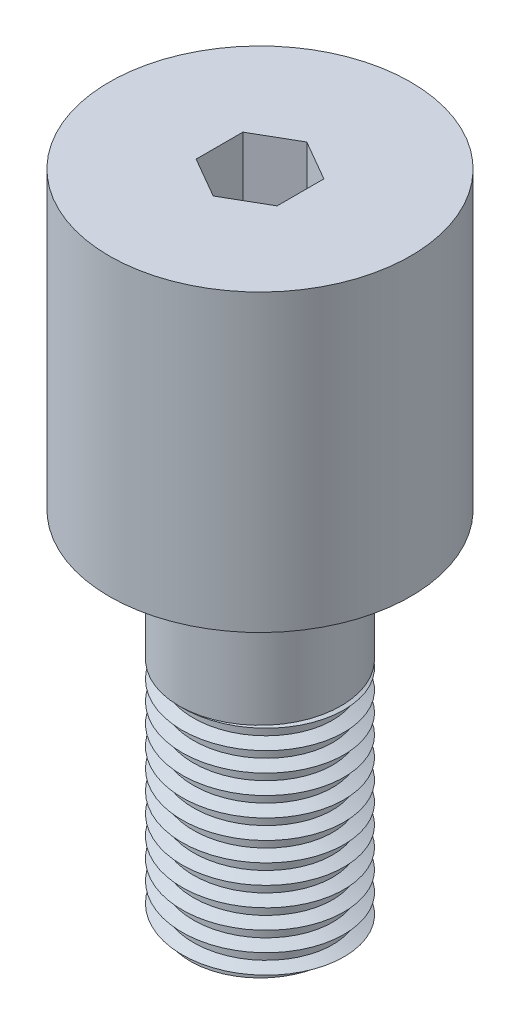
ISO-10303-21;
HEADER;
FILE_DESCRIPTION(('STEP AP214'),'2;1');
FILE_NAME('part.step','',(''),(''),'','','');
FILE_SCHEMA(('AUTOMOTIVE_DESIGN { 1 0 10303 214 1 1 1 1 }'));
ENDSEC;
DATA;
#1=APPLICATION_CONTEXT('core data for automotive mechanical design processes');
#2=APPLICATION_PROTOCOL_DEFINITION('international standard','automotive_design',2000,#1);
#3=PRODUCT_CONTEXT('',#1,'mechanical');
#4=PRODUCT('Part','Part','',(#3));
#5=PRODUCT_RELATED_PRODUCT_CATEGORY('part','',(#4));
#6=PRODUCT_DEFINITION_FORMATION('','',#4);
#7=PRODUCT_DEFINITION_CONTEXT('part definition',#1,'design');
#8=PRODUCT_DEFINITION('design','',#6,#7);
#9=PRODUCT_DEFINITION_SHAPE('','',#8);
#10=(LENGTH_UNIT() NAMED_UNIT(*) SI_UNIT(.MILLI.,.METRE.));
#11=(NAMED_UNIT(*) PLANE_ANGLE_UNIT() SI_UNIT($,.RADIAN.));
#12=(NAMED_UNIT(*) SI_UNIT($,.STERADIAN.) SOLID_ANGLE_UNIT());
#13=UNCERTAINTY_MEASURE_WITH_UNIT(LENGTH_MEASURE(1.E-05),#10,'distance_accuracy_value','');
#14=(GEOMETRIC_REPRESENTATION_CONTEXT(3) GLOBAL_UNCERTAINTY_ASSIGNED_CONTEXT((#13)) GLOBAL_UNIT_ASSIGNED_CONTEXT((#10,
#11,#12)) REPRESENTATION_CONTEXT('',''));
#15=CARTESIAN_POINT('',(0.,0.,0.));
#16=DIRECTION('',(0.,0.,1.));
#17=DIRECTION('',(1.,0.,0.));
#18=AXIS2_PLACEMENT_3D('',#15,#16,#17);
#19=CARTESIAN_POINT('',(0.,-16.637,0.));
#20=DIRECTION('',(0.,-1.,0.));
#21=DIRECTION('',(0.,0.,-1.));
#22=AXIS2_PLACEMENT_3D('',#19,#20,#21);
#23=PLANE('',#22);
#24=CARTESIAN_POINT('',(0.,-16.637,0.));
#25=DIRECTION('',(0.,-1.,0.));
#26=DIRECTION('',(0.,0.,-1.));
#27=AXIS2_PLACEMENT_3D('',#24,#25,#26);
#28=CIRCLE('',#27,2.7305);
#29=CARTESIAN_POINT('',(0.,-16.637,2.7305));
#30=VERTEX_POINT('',#29);
#31=CARTESIAN_POINT('',(2.7305,-16.6369999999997,7.68600233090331E-12));
#32=VERTEX_POINT('',#31);
#33=EDGE_CURVE('E147',#30,#32,#28,.T.);
#34=ORIENTED_EDGE('',*,*,#33,.F.);
#35=DIRECTION('',(0.,0.,1.));
#36=VECTOR('',#35,1.);
#37=CARTESIAN_POINT('',(0.,-16.637,0.));
#38=LINE('',#37,#36);
#39=CARTESIAN_POINT('',(0.,-16.637,3.175));
#40=VERTEX_POINT('',#39);
#41=EDGE_CURVE('E150',#30,#40,#38,.T.);
#42=ORIENTED_EDGE('',*,*,#41,.T.);
#43=CARTESIAN_POINT('',(0.,-16.637,0.));
#44=DIRECTION('',(0.,-1.,0.));
#45=DIRECTION('',(0.,0.,-1.));
#46=AXIS2_PLACEMENT_3D('',#43,#44,#45);
#47=CIRCLE('',#46,3.175);
#48=EDGE_CURVE('E146',#40,#40,#47,.T.);
#49=ORIENTED_EDGE('',*,*,#48,.T.);
#50=CARTESIAN_POINT('',(2.7305,-16.637,0.));
#51=CARTESIAN_POINT('',(2.73828747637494,-16.637,0.0791687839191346));
#52=CARTESIAN_POINT('',(2.74272020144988,-16.637,0.158666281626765));
#53=CARTESIAN_POINT('',(2.7448788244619,-16.637,0.317751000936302));
#54=CARTESIAN_POINT('',(2.74260484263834,-16.637,0.397338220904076));
#55=CARTESIAN_POINT('',(2.73135619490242,-16.637,0.555992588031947));
#56=CARTESIAN_POINT('',(2.72238532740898,-16.637,0.635060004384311));
#57=CARTESIAN_POINT('',(2.69781297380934,-16.637,0.792154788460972));
#58=CARTESIAN_POINT('',(2.68221171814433,-16.637,0.870182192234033));
#59=CARTESIAN_POINT('',(2.64447781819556,-16.637,1.02469085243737));
#60=CARTESIAN_POINT('',(2.62234128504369,-16.637,1.1011711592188));
#61=CARTESIAN_POINT('',(2.57169950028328,-16.637,1.25199315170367));
#62=CARTESIAN_POINT('',(2.54319423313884,-16.637,1.32633483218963));
#63=CARTESIAN_POINT('',(2.48003709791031,-16.637,1.47231578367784));
#64=CARTESIAN_POINT('',(2.44538836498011,-16.637,1.54395641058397));
#65=CARTESIAN_POINT('',(2.37018678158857,-16.637,1.68405371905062));
#66=CARTESIAN_POINT('',(2.32963462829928,-16.637,1.75251077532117));
#67=CARTESIAN_POINT('',(2.24298271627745,-16.637,1.88569593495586));
#68=CARTESIAN_POINT('',(2.19689084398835,-16.637,1.95042914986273));
#69=CARTESIAN_POINT('',(2.1237813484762,-16.637,2.04441373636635));
#70=CARTESIAN_POINT('',(2.0987463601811,-16.637,2.07522619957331));
#71=CARTESIAN_POINT('',(2.04747110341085,-16.637,2.13584025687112));
#72=CARTESIAN_POINT('',(2.02123059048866,-16.637,2.16564164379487));
#73=CARTESIAN_POINT('',(1.94077508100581,-16.637,2.25350566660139));
#74=CARTESIAN_POINT('',(1.88483848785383,-16.637,2.31001234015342));
#75=CARTESIAN_POINT('',(1.76873086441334,-16.637,2.41848578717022));
#76=CARTESIAN_POINT('',(1.70855859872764,-16.637,2.4704512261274));
#77=CARTESIAN_POINT('',(1.51599390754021,-16.637,2.62401053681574));
#78=CARTESIAN_POINT('',(1.37689213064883,-16.637,2.71739884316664));
#79=CARTESIAN_POINT('',(1.0854342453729,-16.637,2.88008493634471));
#80=CARTESIAN_POINT('',(0.9330869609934,-16.637,2.94939860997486));
#81=CARTESIAN_POINT('',(0.651175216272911,-16.637,3.05072520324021));
#82=CARTESIAN_POINT('',(0.523287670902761,-16.637,3.08745935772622));
#83=CARTESIAN_POINT('',(0.263857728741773,-16.637,3.14402771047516));
#84=CARTESIAN_POINT('',(0.132316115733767,-16.637,3.16386550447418));
#85=CARTESIAN_POINT('',(0.,-16.637,3.175));
#86=B_SPLINE_CURVE_WITH_KNOTS('',3,(#50,#51,#52,#53,#54,#55,#56,#57,#58,#59,#60,#61,#62,#63,#64,
#65,#66,#67,#68,#69,#70,#71,#72,#73,#74,#75,#76,#77,#78,#79,#80,#81,#82,#83,#84,#85),
.UNSPECIFIED.,.F.,.F.,(4,2,2,2,2,2,2,2,2,2,2,2,2,2,2,2,2,4),(0.,0.238580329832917,
0.47715638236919,0.715597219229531,0.954029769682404,1.19260448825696,1.43117978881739,
1.66963368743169,1.90805944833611,2.14614971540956,2.26522313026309,2.38432079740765,
2.62257623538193,2.8609014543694,3.36108447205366,3.86093679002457,4.25901596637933,
4.65701040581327),.UNSPECIFIED.);
#87=EDGE_CURVE('E212',#32,#40,#86,.T.);
#88=ORIENTED_EDGE('',*,*,#87,.F.);
#89=EDGE_LOOP('',(#34,#42,#49,#88));
#90=FACE_BOUND('',#89,.T.);
#91=ADVANCED_FACE('F37',(#90),#23,.T.);
#92=CARTESIAN_POINT('',(0.,-11.557,0.));
#93=DIRECTION('',(0.,1.,0.));
#94=DIRECTION('',(0.,0.,1.));
#95=AXIS2_PLACEMENT_3D('',#92,#93,#94);
#96=PLANE('',#95);
#97=CARTESIAN_POINT('',(0.,-11.557,0.));
#98=DIRECTION('',(0.,1.,0.));
#99=DIRECTION('',(0.,0.,1.));
#100=AXIS2_PLACEMENT_3D('',#97,#98,#99);
#101=CIRCLE('',#100,5.9055);
#102=CARTESIAN_POINT('',(0.,-11.557,5.9055));
#103=VERTEX_POINT('',#102);
#104=EDGE_CURVE('E156',#103,#103,#101,.T.);
#105=ORIENTED_EDGE('',*,*,#104,.F.);
#106=EDGE_LOOP('',(#105));
#107=FACE_BOUND('',#106,.T.);
#108=CARTESIAN_POINT('',(0.,-11.557,0.));
#109=DIRECTION('',(0.,1.,0.));
#110=DIRECTION('',(0.,0.,1.));
#111=AXIS2_PLACEMENT_3D('',#108,#109,#110);
#112=CIRCLE('',#111,3.175);
#113=CARTESIAN_POINT('',(0.,-11.557,3.175));
#114=VERTEX_POINT('',#113);
#115=EDGE_CURVE('E46',#114,#114,#112,.F.);
#116=ORIENTED_EDGE('',*,*,#115,.F.);
#117=EDGE_LOOP('',(#116));
#118=FACE_BOUND('',#117,.T.);
#119=ADVANCED_FACE('F327',(#107,#118),#96,.F.);
#120=CARTESIAN_POINT('',(0.,-11.557,0.));
#121=DIRECTION('',(0.,1.,0.));
#122=DIRECTION('',(0.,0.,1.));
#123=AXIS2_PLACEMENT_3D('',#120,#121,#122);
#124=CYLINDRICAL_SURFACE('',#123,5.9055);
#125=ORIENTED_EDGE('',*,*,#104,.T.);
#126=EDGE_LOOP('',(#125));
#127=FACE_BOUND('',#126,.T.);
#128=CARTESIAN_POINT('',(0.,0.,0.));
#129=DIRECTION('',(0.,1.,0.));
#130=DIRECTION('',(0.,0.,1.));
#131=AXIS2_PLACEMENT_3D('',#128,#129,#130);
#132=CIRCLE('',#131,5.9055);
#133=CARTESIAN_POINT('',(0.,0.,5.9055));
#134=VERTEX_POINT('',#133);
#135=EDGE_CURVE('E157',#134,#134,#132,.T.);
#136=ORIENTED_EDGE('',*,*,#135,.F.);
#137=EDGE_LOOP('',(#136));
#138=FACE_BOUND('',#137,.T.);
#139=ADVANCED_FACE('F39',(#127,#138),#124,.T.);
#140=CARTESIAN_POINT('',(0.,0.,0.));
#141=DIRECTION('',(0.,1.,0.));
#142=DIRECTION('',(0.,0.,1.));
#143=AXIS2_PLACEMENT_3D('',#140,#141,#142);
#144=PLANE('',#143);
#145=DIRECTION('',(-0.866025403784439,0.,-0.5));
#146=VECTOR('',#145,1.);
#147=CARTESIAN_POINT('',(1.5875,0.,-0.916543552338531));
#148=LINE('',#147,#146);
#149=CARTESIAN_POINT('',(1.5875,0.,-0.916543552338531));
#150=VERTEX_POINT('',#149);
#151=CARTESIAN_POINT('',(0.,0.,-1.83308710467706));
#152=VERTEX_POINT('',#151);
#153=EDGE_CURVE('E62',#150,#152,#148,.T.);
#154=ORIENTED_EDGE('',*,*,#153,.F.);
#155=DIRECTION('',(0.,0.,-1.));
#156=VECTOR('',#155,1.);
#157=CARTESIAN_POINT('',(1.5875,0.,0.916543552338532));
#158=LINE('',#157,#156);
#159=CARTESIAN_POINT('',(1.5875,0.,0.916543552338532));
#160=VERTEX_POINT('',#159);
#161=EDGE_CURVE('E175',#160,#150,#158,.T.);
#162=ORIENTED_EDGE('',*,*,#161,.F.);
#163=DIRECTION('',(0.866025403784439,0.,-0.5));
#164=VECTOR('',#163,1.);
#165=CARTESIAN_POINT('',(0.,0.,1.83308710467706));
#166=LINE('',#165,#164);
#167=CARTESIAN_POINT('',(0.,0.,1.83308710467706));
#168=VERTEX_POINT('',#167);
#169=EDGE_CURVE('E179',#168,#160,#166,.T.);
#170=ORIENTED_EDGE('',*,*,#169,.F.);
#171=DIRECTION('',(0.866025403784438,0.,0.5));
#172=VECTOR('',#171,1.);
#173=CARTESIAN_POINT('',(-1.5875,0.,0.916543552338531));
#174=LINE('',#173,#172);
#175=CARTESIAN_POINT('',(-1.5875,0.,0.916543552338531));
#176=VERTEX_POINT('',#175);
#177=EDGE_CURVE('E182',#176,#168,#174,.T.);
#178=ORIENTED_EDGE('',*,*,#177,.F.);
#179=DIRECTION('',(0.,0.,1.));
#180=VECTOR('',#179,1.);
#181=CARTESIAN_POINT('',(-1.5875,0.,-0.916543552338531));
#182=LINE('',#181,#180);
#183=CARTESIAN_POINT('',(-1.5875,0.,-0.916543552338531));
#184=VERTEX_POINT('',#183);
#185=EDGE_CURVE('E185',#184,#176,#182,.T.);
#186=ORIENTED_EDGE('',*,*,#185,.F.);
#187=DIRECTION('',(-0.866025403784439,0.,0.5));
#188=VECTOR('',#187,1.);
#189=CARTESIAN_POINT('',(0.,0.,-1.83308710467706));
#190=LINE('',#189,#188);
#191=EDGE_CURVE('E188',#152,#184,#190,.T.);
#192=ORIENTED_EDGE('',*,*,#191,.F.);
#193=EDGE_LOOP('',(#154,#162,#170,#178,#186,#192));
#194=FACE_BOUND('',#193,.T.);
#195=ORIENTED_EDGE('',*,*,#135,.T.);
#196=EDGE_LOOP('',(#195));
#197=FACE_BOUND('',#196,.T.);
#198=ADVANCED_FACE('F336',(#194,#197),#144,.T.);
#199=CARTESIAN_POINT('',(1.5875,-2.794,-0.916543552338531));
#200=DIRECTION('',(0.5,0.,-0.866025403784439));
#201=DIRECTION('',(-0.866025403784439,0.,-0.5));
#202=AXIS2_PLACEMENT_3D('',#199,#200,#201);
#203=PLANE('',#202);
#204=ORIENTED_EDGE('',*,*,#153,.T.);
#205=DIRECTION('',(0.,1.,0.));
#206=VECTOR('',#205,1.);
#207=CARTESIAN_POINT('',(0.,-2.794,-1.83308710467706));
#208=LINE('',#207,#206);
#209=CARTESIAN_POINT('',(0.,-2.794,-1.83308710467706));
#210=VERTEX_POINT('',#209);
#211=EDGE_CURVE('E163',#210,#152,#208,.T.);
#212=ORIENTED_EDGE('',*,*,#211,.F.);
#213=DIRECTION('',(-0.866025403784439,0.,-0.5));
#214=VECTOR('',#213,1.);
#215=CARTESIAN_POINT('',(1.5875,-2.794,-0.916543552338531));
#216=LINE('',#215,#214);
#217=CARTESIAN_POINT('',(1.5875,-2.794,-0.916543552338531));
#218=VERTEX_POINT('',#217);
#219=EDGE_CURVE('E178',#218,#210,#216,.T.);
#220=ORIENTED_EDGE('',*,*,#219,.F.);
#221=DIRECTION('',(0.,1.,0.));
#222=VECTOR('',#221,1.);
#223=CARTESIAN_POINT('',(1.5875,-2.794,-0.916543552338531));
#224=LINE('',#223,#222);
#225=EDGE_CURVE('E160',#218,#150,#224,.T.);
#226=ORIENTED_EDGE('',*,*,#225,.T.);
#227=EDGE_LOOP('',(#204,#212,#220,#226));
#228=FACE_BOUND('',#227,.T.);
#229=ADVANCED_FACE('F341',(#228),#203,.F.);
#230=CARTESIAN_POINT('',(1.5875,-2.794,0.916543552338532));
#231=DIRECTION('',(1.,0.,0.));
#232=DIRECTION('',(0.,0.,-1.));
#233=AXIS2_PLACEMENT_3D('',#230,#231,#232);
#234=PLANE('',#233);
#235=ORIENTED_EDGE('',*,*,#161,.T.);
#236=ORIENTED_EDGE('',*,*,#225,.F.);
#237=DIRECTION('',(0.,0.,-1.));
#238=VECTOR('',#237,1.);
#239=CARTESIAN_POINT('',(1.5875,-2.794,0.916543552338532));
#240=LINE('',#239,#238);
#241=CARTESIAN_POINT('',(1.5875,-2.794,0.916543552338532));
#242=VERTEX_POINT('',#241);
#243=EDGE_CURVE('E166',#242,#218,#240,.T.);
#244=ORIENTED_EDGE('',*,*,#243,.F.);
#245=DIRECTION('',(0.,1.,0.));
#246=VECTOR('',#245,1.);
#247=CARTESIAN_POINT('',(1.5875,-2.794,0.916543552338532));
#248=LINE('',#247,#246);
#249=EDGE_CURVE('E172',#242,#160,#248,.T.);
#250=ORIENTED_EDGE('',*,*,#249,.T.);
#251=EDGE_LOOP('',(#235,#236,#244,#250));
#252=FACE_BOUND('',#251,.T.);
#253=ADVANCED_FACE('F348',(#252),#234,.F.);
#254=CARTESIAN_POINT('',(0.,-2.794,1.83308710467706));
#255=DIRECTION('',(0.5,0.,0.866025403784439));
#256=DIRECTION('',(0.866025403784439,0.,-0.5));
#257=AXIS2_PLACEMENT_3D('',#254,#255,#256);
#258=PLANE('',#257);
#259=ORIENTED_EDGE('',*,*,#169,.T.);
#260=ORIENTED_EDGE('',*,*,#249,.F.);
#261=DIRECTION('',(0.866025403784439,0.,-0.5));
#262=VECTOR('',#261,1.);
#263=CARTESIAN_POINT('',(0.,-2.794,1.83308710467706));
#264=LINE('',#263,#262);
#265=CARTESIAN_POINT('',(0.,-2.794,1.83308710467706));
#266=VERTEX_POINT('',#265);
#267=EDGE_CURVE('E194',#266,#242,#264,.T.);
#268=ORIENTED_EDGE('',*,*,#267,.F.);
#269=DIRECTION('',(0.,1.,0.));
#270=VECTOR('',#269,1.);
#271=CARTESIAN_POINT('',(0.,-2.794,1.83308710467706));
#272=LINE('',#271,#270);
#273=EDGE_CURVE('E170',#266,#168,#272,.T.);
#274=ORIENTED_EDGE('',*,*,#273,.T.);
#275=EDGE_LOOP('',(#259,#260,#268,#274));
#276=FACE_BOUND('',#275,.T.);
#277=ADVANCED_FACE('F368',(#276),#258,.F.);
#278=CARTESIAN_POINT('',(-1.5875,-2.794,0.916543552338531));
#279=DIRECTION('',(-0.5,0.,0.866025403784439));
#280=DIRECTION('',(0.866025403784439,0.,0.5));
#281=AXIS2_PLACEMENT_3D('',#278,#279,#280);
#282=PLANE('',#281);
#283=ORIENTED_EDGE('',*,*,#177,.T.);
#284=ORIENTED_EDGE('',*,*,#273,.F.);
#285=DIRECTION('',(0.866025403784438,0.,0.5));
#286=VECTOR('',#285,1.);
#287=CARTESIAN_POINT('',(-1.5875,-2.794,0.916543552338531));
#288=LINE('',#287,#286);
#289=CARTESIAN_POINT('',(-1.5875,-2.794,0.916543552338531));
#290=VERTEX_POINT('',#289);
#291=EDGE_CURVE('E197',#290,#266,#288,.T.);
#292=ORIENTED_EDGE('',*,*,#291,.F.);
#293=DIRECTION('',(0.,1.,0.));
#294=VECTOR('',#293,1.);
#295=CARTESIAN_POINT('',(-1.5875,-2.794,0.916543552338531));
#296=LINE('',#295,#294);
#297=EDGE_CURVE('E168',#290,#176,#296,.T.);
#298=ORIENTED_EDGE('',*,*,#297,.T.);
#299=EDGE_LOOP('',(#283,#284,#292,#298));
#300=FACE_BOUND('',#299,.T.);
#301=ADVANCED_FACE('F370',(#300),#282,.F.);
#302=CARTESIAN_POINT('',(-1.5875,-2.794,-0.916543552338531));
#303=DIRECTION('',(-1.,0.,0.));
#304=DIRECTION('',(0.,0.,1.));
#305=AXIS2_PLACEMENT_3D('',#302,#303,#304);
#306=PLANE('',#305);
#307=ORIENTED_EDGE('',*,*,#185,.T.);
#308=ORIENTED_EDGE('',*,*,#297,.F.);
#309=DIRECTION('',(0.,0.,1.));
#310=VECTOR('',#309,1.);
#311=CARTESIAN_POINT('',(-1.5875,-2.794,-0.916543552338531));
#312=LINE('',#311,#310);
#313=CARTESIAN_POINT('',(-1.5875,-2.794,-0.916543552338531));
#314=VERTEX_POINT('',#313);
#315=EDGE_CURVE('E200',#314,#290,#312,.T.);
#316=ORIENTED_EDGE('',*,*,#315,.F.);
#317=DIRECTION('',(0.,1.,0.));
#318=VECTOR('',#317,1.);
#319=CARTESIAN_POINT('',(-1.5875,-2.794,-0.916543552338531));
#320=LINE('',#319,#318);
#321=EDGE_CURVE('E165',#314,#184,#320,.T.);
#322=ORIENTED_EDGE('',*,*,#321,.T.);
#323=EDGE_LOOP('',(#307,#308,#316,#322));
#324=FACE_BOUND('',#323,.T.);
#325=ADVANCED_FACE('F373',(#324),#306,.F.);
#326=CARTESIAN_POINT('',(0.,-2.794,-1.83308710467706));
#327=DIRECTION('',(-0.5,0.,-0.866025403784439));
#328=DIRECTION('',(-0.866025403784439,0.,0.5));
#329=AXIS2_PLACEMENT_3D('',#326,#327,#328);
#330=PLANE('',#329);
#331=ORIENTED_EDGE('',*,*,#191,.T.);
#332=ORIENTED_EDGE('',*,*,#321,.F.);
#333=DIRECTION('',(-0.866025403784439,0.,0.5));
#334=VECTOR('',#333,1.);
#335=CARTESIAN_POINT('',(0.,-2.794,-1.83308710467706));
#336=LINE('',#335,#334);
#337=EDGE_CURVE('E203',#210,#314,#336,.T.);
#338=ORIENTED_EDGE('',*,*,#337,.F.);
#339=ORIENTED_EDGE('',*,*,#211,.T.);
#340=EDGE_LOOP('',(#331,#332,#338,#339));
#341=FACE_BOUND('',#340,.T.);
#342=ADVANCED_FACE('F358',(#341),#330,.F.);
#343=CARTESIAN_POINT('',(0.,-2.794,-1.83308710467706));
#344=DIRECTION('',(0.,1.,0.));
#345=DIRECTION('',(0.,0.,1.));
#346=AXIS2_PLACEMENT_3D('',#343,#344,#345);
#347=PLANE('',#346);
#348=ORIENTED_EDGE('',*,*,#219,.T.);
#349=ORIENTED_EDGE('',*,*,#337,.T.);
#350=ORIENTED_EDGE('',*,*,#315,.T.);
#351=ORIENTED_EDGE('',*,*,#291,.T.);
#352=ORIENTED_EDGE('',*,*,#267,.T.);
#353=ORIENTED_EDGE('',*,*,#243,.T.);
#354=EDGE_LOOP('',(#348,#349,#350,#351,#352,#353));
#355=FACE_BOUND('',#354,.T.);
#356=ADVANCED_FACE('F364',(#355),#347,.T.);
#357=CARTESIAN_POINT('',(0.,-16.637,0.));
#358=DIRECTION('',(0.,1.,0.));
#359=DIRECTION('',(0.,0.,1.));
#360=AXIS2_PLACEMENT_3D('',#357,#358,#359);
#361=CYLINDRICAL_SURFACE('',#360,3.175);
#362=ORIENTED_EDGE('',*,*,#48,.F.);
#363=EDGE_LOOP('',(#362));
#364=FACE_BOUND('',#363,.T.);
#365=ORIENTED_EDGE('',*,*,#115,.T.);
#366=EDGE_LOOP('',(#365));
#367=FACE_BOUND('',#366,.T.);
#368=ADVANCED_FACE('F387',(#364,#367),#361,.T.);
#369=CARTESIAN_POINT('',(0.,-25.527,0.));
#370=DIRECTION('',(0.,1.,0.));
#371=DIRECTION('',(0.,0.,1.));
#372=AXIS2_PLACEMENT_3D('',#369,#370,#371);
#373=CYLINDRICAL_SURFACE('',#372,2.7305);
#374=CARTESIAN_POINT('',(0.,-16.8275,2.7305));
#375=CARTESIAN_POINT('',(1.13101013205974,-16.875125,2.7305));
#376=CARTESIAN_POINT('',(1.93075506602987,-16.92275,1.93075506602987));
#377=CARTESIAN_POINT('',(2.7305,-16.970375,1.13101013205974));
#378=CARTESIAN_POINT('',(2.7305,-17.018,0.));
#379=CARTESIAN_POINT('',(2.7305,-17.065625,-1.13101013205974));
#380=CARTESIAN_POINT('',(1.93075506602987,-17.11325,-1.93075506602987));
#381=CARTESIAN_POINT('',(1.13101013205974,-17.160875,-2.7305));
#382=CARTESIAN_POINT('',(0.,-17.2085,-2.7305));
#383=CARTESIAN_POINT('',(-1.13101013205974,-17.256125,-2.7305));
#384=CARTESIAN_POINT('',(-1.93075506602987,-17.30375,-1.93075506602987));
#385=CARTESIAN_POINT('',(-2.7305,-17.351375,-1.13101013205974));
#386=CARTESIAN_POINT('',(-2.7305,-17.399,0.));
#387=CARTESIAN_POINT('',(-2.7305,-17.446625,1.13101013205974));
#388=CARTESIAN_POINT('',(-1.93075506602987,-17.49425,1.93075506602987));
#389=CARTESIAN_POINT('',(-1.13101013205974,-17.541875,2.7305));
#390=CARTESIAN_POINT('',(0.,-17.5895,2.7305));
#391=CARTESIAN_POINT('',(1.13101013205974,-17.637125,2.7305));
#392=CARTESIAN_POINT('',(1.93075506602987,-17.68475,1.93075506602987));
#393=CARTESIAN_POINT('',(2.7305,-17.732375,1.13101013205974));
#394=CARTESIAN_POINT('',(2.7305,-17.78,0.));
#395=CARTESIAN_POINT('',(2.7305,-17.827625,-1.13101013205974));
#396=CARTESIAN_POINT('',(1.93075506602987,-17.87525,-1.93075506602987));
#397=CARTESIAN_POINT('',(1.13101013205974,-17.922875,-2.7305));
#398=CARTESIAN_POINT('',(0.,-17.9705,-2.7305));
#399=CARTESIAN_POINT('',(-1.13101013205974,-18.018125,-2.7305));
#400=CARTESIAN_POINT('',(-1.93075506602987,-18.06575,-1.93075506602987));
#401=CARTESIAN_POINT('',(-2.7305,-18.113375,-1.13101013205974));
#402=CARTESIAN_POINT('',(-2.7305,-18.161,0.));
#403=CARTESIAN_POINT('',(-2.7305,-18.208625,1.13101013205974));
#404=CARTESIAN_POINT('',(-1.93075506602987,-18.25625,1.93075506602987));
#405=CARTESIAN_POINT('',(-1.13101013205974,-18.303875,2.7305));
#406=CARTESIAN_POINT('',(0.,-18.3515,2.7305));
#407=CARTESIAN_POINT('',(1.13101013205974,-18.399125,2.7305));
#408=CARTESIAN_POINT('',(1.93075506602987,-18.44675,1.93075506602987));
#409=CARTESIAN_POINT('',(2.7305,-18.494375,1.13101013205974));
#410=CARTESIAN_POINT('',(2.7305,-18.542,0.));
#411=CARTESIAN_POINT('',(2.7305,-18.589625,-1.13101013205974));
#412=CARTESIAN_POINT('',(1.93075506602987,-18.63725,-1.93075506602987));
#413=CARTESIAN_POINT('',(1.13101013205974,-18.684875,-2.7305));
#414=CARTESIAN_POINT('',(0.,-18.7325,-2.7305));
#415=CARTESIAN_POINT('',(-1.13101013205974,-18.780125,-2.7305));
#416=CARTESIAN_POINT('',(-1.93075506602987,-18.82775,-1.93075506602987));
#417=CARTESIAN_POINT('',(-2.7305,-18.875375,-1.13101013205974));
#418=CARTESIAN_POINT('',(-2.7305,-18.923,0.));
#419=CARTESIAN_POINT('',(-2.7305,-18.970625,1.13101013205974));
#420=CARTESIAN_POINT('',(-1.93075506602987,-19.01825,1.93075506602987));
#421=CARTESIAN_POINT('',(-1.13101013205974,-19.065875,2.7305));
#422=CARTESIAN_POINT('',(0.,-19.1135,2.7305));
#423=CARTESIAN_POINT('',(1.13101013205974,-19.161125,2.7305));
#424=CARTESIAN_POINT('',(1.93075506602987,-19.20875,1.93075506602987));
#425=CARTESIAN_POINT('',(2.7305,-19.256375,1.13101013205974));
#426=CARTESIAN_POINT('',(2.7305,-19.304,0.));
#427=CARTESIAN_POINT('',(2.7305,-19.351625,-1.13101013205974));
#428=CARTESIAN_POINT('',(1.93075506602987,-19.39925,-1.93075506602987));
#429=CARTESIAN_POINT('',(1.13101013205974,-19.446875,-2.7305));
#430=CARTESIAN_POINT('',(0.,-19.4945,-2.7305));
#431=CARTESIAN_POINT('',(-1.13101013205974,-19.542125,-2.7305));
#432=CARTESIAN_POINT('',(-1.93075506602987,-19.58975,-1.93075506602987));
#433=CARTESIAN_POINT('',(-2.7305,-19.637375,-1.13101013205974));
#434=CARTESIAN_POINT('',(-2.7305,-19.685,0.));
#435=CARTESIAN_POINT('',(-2.7305,-19.732625,1.13101013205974));
#436=CARTESIAN_POINT('',(-1.93075506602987,-19.78025,1.93075506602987));
#437=CARTESIAN_POINT('',(-1.13101013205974,-19.827875,2.7305));
#438=CARTESIAN_POINT('',(0.,-19.8755,2.7305));
#439=CARTESIAN_POINT('',(1.13101013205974,-19.923125,2.7305));
#440=CARTESIAN_POINT('',(1.93075506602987,-19.97075,1.93075506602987));
#441=CARTESIAN_POINT('',(2.7305,-20.018375,1.13101013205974));
#442=CARTESIAN_POINT('',(2.7305,-20.066,0.));
#443=CARTESIAN_POINT('',(2.7305,-20.113625,-1.13101013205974));
#444=CARTESIAN_POINT('',(1.93075506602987,-20.16125,-1.93075506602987));
#445=CARTESIAN_POINT('',(1.13101013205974,-20.208875,-2.7305));
#446=CARTESIAN_POINT('',(0.,-20.2565,-2.7305));
#447=CARTESIAN_POINT('',(-1.13101013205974,-20.304125,-2.7305));
#448=CARTESIAN_POINT('',(-1.93075506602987,-20.35175,-1.93075506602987));
#449=CARTESIAN_POINT('',(-2.7305,-20.399375,-1.13101013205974));
#450=CARTESIAN_POINT('',(-2.7305,-20.447,0.));
#451=CARTESIAN_POINT('',(-2.7305,-20.494625,1.13101013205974));
#452=CARTESIAN_POINT('',(-1.93075506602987,-20.54225,1.93075506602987));
#453=CARTESIAN_POINT('',(-1.13101013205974,-20.589875,2.7305));
#454=CARTESIAN_POINT('',(0.,-20.6375,2.7305));
#455=CARTESIAN_POINT('',(1.13101013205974,-20.685125,2.7305));
#456=CARTESIAN_POINT('',(1.93075506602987,-20.73275,1.93075506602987));
#457=CARTESIAN_POINT('',(2.7305,-20.780375,1.13101013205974));
#458=CARTESIAN_POINT('',(2.7305,-20.828,0.));
#459=CARTESIAN_POINT('',(2.7305,-20.875625,-1.13101013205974));
#460=CARTESIAN_POINT('',(1.93075506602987,-20.92325,-1.93075506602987));
#461=CARTESIAN_POINT('',(1.13101013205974,-20.970875,-2.7305));
#462=CARTESIAN_POINT('',(0.,-21.0185,-2.7305));
#463=CARTESIAN_POINT('',(-1.13101013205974,-21.066125,-2.7305));
#464=CARTESIAN_POINT('',(-1.93075506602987,-21.11375,-1.93075506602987));
#465=CARTESIAN_POINT('',(-2.7305,-21.161375,-1.13101013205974));
#466=CARTESIAN_POINT('',(-2.7305,-21.209,0.));
#467=CARTESIAN_POINT('',(-2.7305,-21.256625,1.13101013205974));
#468=CARTESIAN_POINT('',(-1.93075506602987,-21.30425,1.93075506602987));
#469=CARTESIAN_POINT('',(-1.13101013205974,-21.351875,2.7305));
#470=CARTESIAN_POINT('',(0.,-21.3995,2.7305));
#471=CARTESIAN_POINT('',(1.13101013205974,-21.447125,2.7305));
#472=CARTESIAN_POINT('',(1.93075506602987,-21.49475,1.93075506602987));
#473=CARTESIAN_POINT('',(2.7305,-21.542375,1.13101013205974));
#474=CARTESIAN_POINT('',(2.7305,-21.59,0.));
#475=CARTESIAN_POINT('',(2.7305,-21.637625,-1.13101013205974));
#476=CARTESIAN_POINT('',(1.93075506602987,-21.68525,-1.93075506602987));
#477=CARTESIAN_POINT('',(1.13101013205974,-21.732875,-2.7305));
#478=CARTESIAN_POINT('',(0.,-21.7805,-2.7305));
#479=CARTESIAN_POINT('',(-1.13101013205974,-21.828125,-2.7305));
#480=CARTESIAN_POINT('',(-1.93075506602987,-21.87575,-1.93075506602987));
#481=CARTESIAN_POINT('',(-2.7305,-21.923375,-1.13101013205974));
#482=CARTESIAN_POINT('',(-2.7305,-21.971,0.));
#483=CARTESIAN_POINT('',(-2.7305,-22.018625,1.13101013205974));
#484=CARTESIAN_POINT('',(-1.93075506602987,-22.06625,1.93075506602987));
#485=CARTESIAN_POINT('',(-1.13101013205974,-22.113875,2.7305));
#486=CARTESIAN_POINT('',(0.,-22.1615,2.7305));
#487=CARTESIAN_POINT('',(1.13101013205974,-22.209125,2.7305));
#488=CARTESIAN_POINT('',(1.93075506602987,-22.25675,1.93075506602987));
#489=CARTESIAN_POINT('',(2.7305,-22.304375,1.13101013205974));
#490=CARTESIAN_POINT('',(2.7305,-22.352,0.));
#491=CARTESIAN_POINT('',(2.7305,-22.399625,-1.13101013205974));
#492=CARTESIAN_POINT('',(1.93075506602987,-22.44725,-1.93075506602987));
#493=CARTESIAN_POINT('',(1.13101013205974,-22.494875,-2.7305));
#494=CARTESIAN_POINT('',(0.,-22.5425,-2.7305));
#495=CARTESIAN_POINT('',(-1.13101013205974,-22.590125,-2.7305));
#496=CARTESIAN_POINT('',(-1.93075506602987,-22.63775,-1.93075506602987));
#497=CARTESIAN_POINT('',(-2.7305,-22.685375,-1.13101013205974));
#498=CARTESIAN_POINT('',(-2.7305,-22.733,0.));
#499=CARTESIAN_POINT('',(-2.7305,-22.780625,1.13101013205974));
#500=CARTESIAN_POINT('',(-1.93075506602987,-22.82825,1.93075506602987));
#501=CARTESIAN_POINT('',(-1.13101013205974,-22.875875,2.7305));
#502=CARTESIAN_POINT('',(0.,-22.9235,2.7305));
#503=CARTESIAN_POINT('',(1.13101013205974,-22.971125,2.7305));
#504=CARTESIAN_POINT('',(1.93075506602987,-23.01875,1.93075506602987));
#505=CARTESIAN_POINT('',(2.7305,-23.066375,1.13101013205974));
#506=CARTESIAN_POINT('',(2.7305,-23.114,0.));
#507=CARTESIAN_POINT('',(2.7305,-23.161625,-1.13101013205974));
#508=CARTESIAN_POINT('',(1.93075506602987,-23.20925,-1.93075506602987));
#509=CARTESIAN_POINT('',(1.13101013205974,-23.256875,-2.7305));
#510=CARTESIAN_POINT('',(0.,-23.3045,-2.7305));
#511=CARTESIAN_POINT('',(-1.13101013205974,-23.352125,-2.7305));
#512=CARTESIAN_POINT('',(-1.93075506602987,-23.39975,-1.93075506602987));
#513=CARTESIAN_POINT('',(-2.7305,-23.447375,-1.13101013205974));
#514=CARTESIAN_POINT('',(-2.7305,-23.495,0.));
#515=CARTESIAN_POINT('',(-2.7305,-23.542625,1.13101013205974));
#516=CARTESIAN_POINT('',(-1.93075506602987,-23.59025,1.93075506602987));
#517=CARTESIAN_POINT('',(-1.13101013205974,-23.637875,2.7305));
#518=CARTESIAN_POINT('',(0.,-23.6855,2.7305));
#519=CARTESIAN_POINT('',(1.13101013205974,-23.733125,2.7305));
#520=CARTESIAN_POINT('',(1.93075506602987,-23.78075,1.93075506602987));
#521=CARTESIAN_POINT('',(2.7305,-23.828375,1.13101013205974));
#522=CARTESIAN_POINT('',(2.7305,-23.876,0.));
#523=CARTESIAN_POINT('',(2.7305,-23.923625,-1.13101013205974));
#524=CARTESIAN_POINT('',(1.93075506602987,-23.97125,-1.93075506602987));
#525=CARTESIAN_POINT('',(1.13101013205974,-24.018875,-2.7305));
#526=CARTESIAN_POINT('',(0.,-24.0665,-2.7305));
#527=CARTESIAN_POINT('',(-1.13101013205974,-24.114125,-2.7305));
#528=CARTESIAN_POINT('',(-1.93075506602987,-24.16175,-1.93075506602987));
#529=CARTESIAN_POINT('',(-2.7305,-24.209375,-1.13101013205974));
#530=CARTESIAN_POINT('',(-2.7305,-24.257,0.));
#531=CARTESIAN_POINT('',(-2.7305,-24.304625,1.13101013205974));
#532=CARTESIAN_POINT('',(-1.93075506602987,-24.35225,1.93075506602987));
#533=CARTESIAN_POINT('',(-1.13101013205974,-24.399875,2.7305));
#534=CARTESIAN_POINT('',(0.,-24.4475,2.7305));
#535=CARTESIAN_POINT('',(1.13101013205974,-24.495125,2.7305));
#536=CARTESIAN_POINT('',(1.93075506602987,-24.54275,1.93075506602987));
#537=CARTESIAN_POINT('',(2.7305,-24.590375,1.13101013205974));
#538=CARTESIAN_POINT('',(2.7305,-24.638,0.));
#539=CARTESIAN_POINT('',(2.7305,-24.685625,-1.13101013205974));
#540=CARTESIAN_POINT('',(1.93075506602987,-24.73325,-1.93075506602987));
#541=CARTESIAN_POINT('',(1.13101013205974,-24.780875,-2.7305));
#542=CARTESIAN_POINT('',(0.,-24.8285,-2.7305));
#543=CARTESIAN_POINT('',(-1.13101013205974,-24.876125,-2.7305));
#544=CARTESIAN_POINT('',(-1.93075506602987,-24.92375,-1.93075506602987));
#545=CARTESIAN_POINT('',(-2.7305,-24.971375,-1.13101013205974));
#546=CARTESIAN_POINT('',(-2.7305,-25.019,0.));
#547=CARTESIAN_POINT('',(-2.7305,-25.066625,1.13101013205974));
#548=CARTESIAN_POINT('',(-1.93075506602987,-25.11425,1.93075506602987));
#549=CARTESIAN_POINT('',(-1.13101013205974,-25.161875,2.7305));
#550=CARTESIAN_POINT('',(0.,-25.2095,2.7305));
#551=CARTESIAN_POINT('',(1.13101013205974,-25.257125,2.7305));
#552=CARTESIAN_POINT('',(1.93075506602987,-25.30475,1.93075506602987));
#553=CARTESIAN_POINT('',(2.7305,-25.352375,1.13101013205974));
#554=CARTESIAN_POINT('',(2.7305,-25.4,0.));
#555=CARTESIAN_POINT('',(2.7305,-25.447625,-1.13101013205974));
#556=CARTESIAN_POINT('',(1.93075506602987,-25.49525,-1.93075506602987));
#557=CARTESIAN_POINT('',(1.67656191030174,-25.5103872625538,-2.184948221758));
#558=CARTESIAN_POINT('',(1.36523933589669,-25.5266315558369,-2.36468852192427));
#559=(BOUNDED_CURVE() B_SPLINE_CURVE(2,(#374,#375,#376,#377,#378,#379,#380,#381,#382,#383,#384,
#385,#386,#387,#388,#389,#390,#391,#392,#393,#394,#395,#396,#397,#398,#399,#400,#401,#402,#403,
#404,#405,#406,#407,#408,#409,#410,#411,#412,#413,#414,#415,#416,#417,#418,#419,#420,#421,#422,
#423,#424,#425,#426,#427,#428,#429,#430,#431,#432,#433,#434,#435,#436,#437,#438,#439,#440,#441,
#442,#443,#444,#445,#446,#447,#448,#449,#450,#451,#452,#453,#454,#455,#456,#457,#458,#459,#460,
#461,#462,#463,#464,#465,#466,#467,#468,#469,#470,#471,#472,#473,#474,#475,#476,#477,#478,#479,
#480,#481,#482,#483,#484,#485,#486,#487,#488,#489,#490,#491,#492,#493,#494,#495,#496,#497,#498,
#499,#500,#501,#502,#503,#504,#505,#506,#507,#508,#509,#510,#511,#512,#513,#514,#515,#516,#517,
#518,#519,#520,#521,#522,#523,#524,#525,#526,#527,#528,#529,#530,#531,#532,#533,#534,#535,#536,
#537,#538,#539,#540,#541,#542,#543,#544,#545,#546,#547,#548,#549,#550,#551,#552,#553,#554,#555,
#556,#557,#558),.UNSPECIFIED.,.F.,.F.) B_SPLINE_CURVE_WITH_KNOTS((3,2,2,2,2,2,2,2,2,2,2,2,2,2,2,
2,2,2,2,2,2,2,2,2,2,2,2,2,2,2,2,2,2,2,2,2,2,2,2,2,2,2,2,2,2,2,2,2,2,2,2,2,2,2,2,2,2,2,2,2,2,2,2,
2,2,2,2,2,2,2,2,2,2,2,2,2,2,2,2,2,2,2,2,2,2,2,2,2,2,2,2,2,3),(0.,0.0104166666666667,
0.0208333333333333,0.03125,0.0416666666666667,0.0520833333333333,0.0625,0.0729166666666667,
0.0833333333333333,0.09375,0.104166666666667,0.114583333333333,0.125,0.135416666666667,
0.145833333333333,0.15625,0.166666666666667,0.177083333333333,0.1875,0.197916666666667,
0.208333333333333,0.21875,0.229166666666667,0.239583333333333,0.25,0.260416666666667,
0.270833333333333,0.28125,0.291666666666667,0.302083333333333,0.3125,0.322916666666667,
0.333333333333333,0.34375,0.354166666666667,0.364583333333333,0.375,0.385416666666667,
0.395833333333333,0.40625,0.416666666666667,0.427083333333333,0.4375,0.447916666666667,
0.458333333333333,0.46875,0.479166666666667,0.489583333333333,0.5,0.510416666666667,
0.520833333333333,0.53125,0.541666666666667,0.552083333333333,0.5625,0.572916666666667,
0.583333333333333,0.59375,0.604166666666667,0.614583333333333,0.625,0.635416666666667,
0.645833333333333,0.65625,0.666666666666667,0.677083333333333,0.6875,0.697916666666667,
0.708333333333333,0.71875,0.729166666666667,0.739583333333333,0.75,0.760416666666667,
0.770833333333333,0.78125,0.791666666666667,0.802083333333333,0.8125,0.822916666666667,
0.833333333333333,0.84375,0.854166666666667,0.864583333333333,0.875,0.885416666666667,
0.895833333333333,0.90625,0.916666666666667,0.927083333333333,0.9375,0.947916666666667,
0.951408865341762),
.UNSPECIFIED.) CURVE() GEOMETRIC_REPRESENTATION_ITEM() RATIONAL_B_SPLINE_CURVE((1.,
0.923879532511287,1.,0.923879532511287,1.,0.923879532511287,1.,0.923879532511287,1.,
0.923879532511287,1.,0.923879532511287,1.,0.923879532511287,1.,0.923879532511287,1.,
0.923879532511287,1.,0.923879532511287,1.,0.923879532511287,1.,0.923879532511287,1.,
0.923879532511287,1.,0.923879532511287,1.,0.923879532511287,1.,0.923879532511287,1.,
0.923879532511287,1.,0.923879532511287,1.,0.923879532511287,1.,0.923879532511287,1.,
0.923879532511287,1.,0.923879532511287,1.,0.923879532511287,1.,0.923879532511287,1.,
0.923879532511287,1.,0.923879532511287,1.,0.923879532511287,1.,0.923879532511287,1.,
0.923879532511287,1.,0.923879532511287,1.,0.923879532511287,1.,0.923879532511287,1.,
0.923879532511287,1.,0.923879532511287,1.,0.923879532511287,1.,0.923879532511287,1.,
0.923879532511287,1.,0.923879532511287,1.,0.923879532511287,1.,0.923879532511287,1.,
0.923879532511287,1.,0.923879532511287,1.,0.923879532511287,1.,0.923879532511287,1.,
0.923879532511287,1.,0.923879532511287,1.,0.923879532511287,1.,0.923879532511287,1.,
0.923879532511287,1.,0.923879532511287,1.,0.923879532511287,1.,0.923879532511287,1.,
0.923879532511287,1.,0.923879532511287,1.,0.923879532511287,1.,0.923879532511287,1.,
0.923879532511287,1.,0.923879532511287,1.,0.923879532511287,1.,0.923879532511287,1.,
0.923879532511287,1.,0.923879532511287,1.,0.923879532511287,1.,0.923879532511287,1.,
0.923879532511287,1.,0.923879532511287,1.,0.923879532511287,1.,0.923879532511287,1.,
0.923879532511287,1.,0.923879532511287,1.,0.923879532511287,1.,0.923879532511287,1.,
0.923879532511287,1.,0.923879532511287,1.,0.923879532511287,1.,0.923879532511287,1.,
0.923879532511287,1.,0.923879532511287,1.,0.923879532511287,1.,0.923879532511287,1.,
0.923879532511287,1.,0.923879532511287,1.,0.923879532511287,1.,0.923879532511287,1.,
0.923879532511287,1.,0.923879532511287,1.,0.923879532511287,1.,0.923879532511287,1.,
0.923879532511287,1.,0.923879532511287,1.,0.923879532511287,1.,0.974480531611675,0.96607192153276)) REPRESENTATION_ITEM(''));
#560=CARTESIAN_POINT('',(0.,-16.8275,2.7305));
#561=VERTEX_POINT('',#560);
#562=CARTESIAN_POINT('',(1.36523746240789,-25.5268157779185,-2.36468960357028));
#563=VERTEX_POINT('',#562);
#564=EDGE_CURVE('E127',#561,#563,#559,.T.);
#565=ORIENTED_EDGE('',*,*,#564,.F.);
#566=DIRECTION('',(0.,1.,0.));
#567=VECTOR('',#566,1.);
#568=CARTESIAN_POINT('',(0.,-16.637,2.7305));
#569=LINE('',#568,#567);
#570=EDGE_CURVE('E54',#561,#30,#569,.T.);
#571=ORIENTED_EDGE('',*,*,#570,.T.);
#572=ORIENTED_EDGE('',*,*,#33,.T.);
#573=CARTESIAN_POINT('',(0.,-16.4465,2.7305));
#574=CARTESIAN_POINT('',(1.13101013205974,-16.494125,2.7305));
#575=CARTESIAN_POINT('',(1.93075506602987,-16.54175,1.93075506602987));
#576=CARTESIAN_POINT('',(2.7305,-16.589375,1.13101013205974));
#577=CARTESIAN_POINT('',(2.7305,-16.637,0.));
#578=CARTESIAN_POINT('',(2.7305,-16.684625,-1.13101013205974));
#579=CARTESIAN_POINT('',(1.93075506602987,-16.73225,-1.93075506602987));
#580=CARTESIAN_POINT('',(1.13101013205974,-16.779875,-2.7305));
#581=CARTESIAN_POINT('',(0.,-16.8275,-2.7305));
#582=CARTESIAN_POINT('',(-1.13101013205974,-16.875125,-2.7305));
#583=CARTESIAN_POINT('',(-1.93075506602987,-16.92275,-1.93075506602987));
#584=CARTESIAN_POINT('',(-2.7305,-16.970375,-1.13101013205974));
#585=CARTESIAN_POINT('',(-2.7305,-17.018,0.));
#586=CARTESIAN_POINT('',(-2.7305,-17.065625,1.13101013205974));
#587=CARTESIAN_POINT('',(-1.93075506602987,-17.11325,1.93075506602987));
#588=CARTESIAN_POINT('',(-1.13101013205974,-17.160875,2.7305));
#589=CARTESIAN_POINT('',(0.,-17.2085,2.7305));
#590=CARTESIAN_POINT('',(1.13101013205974,-17.256125,2.7305));
#591=CARTESIAN_POINT('',(1.93075506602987,-17.30375,1.93075506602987));
#592=CARTESIAN_POINT('',(2.7305,-17.351375,1.13101013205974));
#593=CARTESIAN_POINT('',(2.7305,-17.399,0.));
#594=CARTESIAN_POINT('',(2.7305,-17.446625,-1.13101013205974));
#595=CARTESIAN_POINT('',(1.93075506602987,-17.49425,-1.93075506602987));
#596=CARTESIAN_POINT('',(1.13101013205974,-17.541875,-2.7305));
#597=CARTESIAN_POINT('',(0.,-17.5895,-2.7305));
#598=CARTESIAN_POINT('',(-1.13101013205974,-17.637125,-2.7305));
#599=CARTESIAN_POINT('',(-1.93075506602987,-17.68475,-1.93075506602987));
#600=CARTESIAN_POINT('',(-2.7305,-17.732375,-1.13101013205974));
#601=CARTESIAN_POINT('',(-2.7305,-17.78,0.));
#602=CARTESIAN_POINT('',(-2.7305,-17.827625,1.13101013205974));
#603=CARTESIAN_POINT('',(-1.93075506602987,-17.87525,1.93075506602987));
#604=CARTESIAN_POINT('',(-1.13101013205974,-17.922875,2.7305));
#605=CARTESIAN_POINT('',(0.,-17.9705,2.7305));
#606=CARTESIAN_POINT('',(1.13101013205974,-18.018125,2.7305));
#607=CARTESIAN_POINT('',(1.93075506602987,-18.06575,1.93075506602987));
#608=CARTESIAN_POINT('',(2.7305,-18.113375,1.13101013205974));
#609=CARTESIAN_POINT('',(2.7305,-18.161,0.));
#610=CARTESIAN_POINT('',(2.7305,-18.208625,-1.13101013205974));
#611=CARTESIAN_POINT('',(1.93075506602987,-18.25625,-1.93075506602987));
#612=CARTESIAN_POINT('',(1.13101013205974,-18.303875,-2.7305));
#613=CARTESIAN_POINT('',(0.,-18.3515,-2.7305));
#614=CARTESIAN_POINT('',(-1.13101013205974,-18.399125,-2.7305));
#615=CARTESIAN_POINT('',(-1.93075506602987,-18.44675,-1.93075506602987));
#616=CARTESIAN_POINT('',(-2.7305,-18.494375,-1.13101013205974));
#617=CARTESIAN_POINT('',(-2.7305,-18.542,0.));
#618=CARTESIAN_POINT('',(-2.7305,-18.589625,1.13101013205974));
#619=CARTESIAN_POINT('',(-1.93075506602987,-18.63725,1.93075506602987));
#620=CARTESIAN_POINT('',(-1.13101013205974,-18.684875,2.7305));
#621=CARTESIAN_POINT('',(0.,-18.7325,2.7305));
#622=CARTESIAN_POINT('',(1.13101013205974,-18.780125,2.7305));
#623=CARTESIAN_POINT('',(1.93075506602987,-18.82775,1.93075506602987));
#624=CARTESIAN_POINT('',(2.7305,-18.875375,1.13101013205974));
#625=CARTESIAN_POINT('',(2.7305,-18.923,0.));
#626=CARTESIAN_POINT('',(2.7305,-18.970625,-1.13101013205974));
#627=CARTESIAN_POINT('',(1.93075506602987,-19.01825,-1.93075506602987));
#628=CARTESIAN_POINT('',(1.13101013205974,-19.065875,-2.7305));
#629=CARTESIAN_POINT('',(0.,-19.1135,-2.7305));
#630=CARTESIAN_POINT('',(-1.13101013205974,-19.161125,-2.7305));
#631=CARTESIAN_POINT('',(-1.93075506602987,-19.20875,-1.93075506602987));
#632=CARTESIAN_POINT('',(-2.7305,-19.256375,-1.13101013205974));
#633=CARTESIAN_POINT('',(-2.7305,-19.304,0.));
#634=CARTESIAN_POINT('',(-2.7305,-19.351625,1.13101013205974));
#635=CARTESIAN_POINT('',(-1.93075506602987,-19.39925,1.93075506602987));
#636=CARTESIAN_POINT('',(-1.13101013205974,-19.446875,2.7305));
#637=CARTESIAN_POINT('',(0.,-19.4945,2.7305));
#638=CARTESIAN_POINT('',(1.13101013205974,-19.542125,2.7305));
#639=CARTESIAN_POINT('',(1.93075506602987,-19.58975,1.93075506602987));
#640=CARTESIAN_POINT('',(2.7305,-19.637375,1.13101013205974));
#641=CARTESIAN_POINT('',(2.7305,-19.685,0.));
#642=CARTESIAN_POINT('',(2.7305,-19.732625,-1.13101013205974));
#643=CARTESIAN_POINT('',(1.93075506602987,-19.78025,-1.93075506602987));
#644=CARTESIAN_POINT('',(1.13101013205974,-19.827875,-2.7305));
#645=CARTESIAN_POINT('',(0.,-19.8755,-2.7305));
#646=CARTESIAN_POINT('',(-1.13101013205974,-19.923125,-2.7305));
#647=CARTESIAN_POINT('',(-1.93075506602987,-19.97075,-1.93075506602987));
#648=CARTESIAN_POINT('',(-2.7305,-20.018375,-1.13101013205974));
#649=CARTESIAN_POINT('',(-2.7305,-20.066,0.));
#650=CARTESIAN_POINT('',(-2.7305,-20.113625,1.13101013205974));
#651=CARTESIAN_POINT('',(-1.93075506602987,-20.16125,1.93075506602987));
#652=CARTESIAN_POINT('',(-1.13101013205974,-20.208875,2.7305));
#653=CARTESIAN_POINT('',(0.,-20.2565,2.7305));
#654=CARTESIAN_POINT('',(1.13101013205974,-20.304125,2.7305));
#655=CARTESIAN_POINT('',(1.93075506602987,-20.35175,1.93075506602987));
#656=CARTESIAN_POINT('',(2.7305,-20.399375,1.13101013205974));
#657=CARTESIAN_POINT('',(2.7305,-20.447,0.));
#658=CARTESIAN_POINT('',(2.7305,-20.494625,-1.13101013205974));
#659=CARTESIAN_POINT('',(1.93075506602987,-20.54225,-1.93075506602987));
#660=CARTESIAN_POINT('',(1.13101013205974,-20.589875,-2.7305));
#661=CARTESIAN_POINT('',(0.,-20.6375,-2.7305));
#662=CARTESIAN_POINT('',(-1.13101013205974,-20.685125,-2.7305));
#663=CARTESIAN_POINT('',(-1.93075506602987,-20.73275,-1.93075506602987));
#664=CARTESIAN_POINT('',(-2.7305,-20.780375,-1.13101013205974));
#665=CARTESIAN_POINT('',(-2.7305,-20.828,0.));
#666=CARTESIAN_POINT('',(-2.7305,-20.875625,1.13101013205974));
#667=CARTESIAN_POINT('',(-1.93075506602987,-20.92325,1.93075506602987));
#668=CARTESIAN_POINT('',(-1.13101013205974,-20.970875,2.7305));
#669=CARTESIAN_POINT('',(0.,-21.0185,2.7305));
#670=CARTESIAN_POINT('',(1.13101013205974,-21.066125,2.7305));
#671=CARTESIAN_POINT('',(1.93075506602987,-21.11375,1.93075506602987));
#672=CARTESIAN_POINT('',(2.7305,-21.161375,1.13101013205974));
#673=CARTESIAN_POINT('',(2.7305,-21.209,0.));
#674=CARTESIAN_POINT('',(2.7305,-21.256625,-1.13101013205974));
#675=CARTESIAN_POINT('',(1.93075506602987,-21.30425,-1.93075506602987));
#676=CARTESIAN_POINT('',(1.13101013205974,-21.351875,-2.7305));
#677=CARTESIAN_POINT('',(0.,-21.3995,-2.7305));
#678=CARTESIAN_POINT('',(-1.13101013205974,-21.447125,-2.7305));
#679=CARTESIAN_POINT('',(-1.93075506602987,-21.49475,-1.93075506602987));
#680=CARTESIAN_POINT('',(-2.7305,-21.542375,-1.13101013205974));
#681=CARTESIAN_POINT('',(-2.7305,-21.59,0.));
#682=CARTESIAN_POINT('',(-2.7305,-21.637625,1.13101013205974));
#683=CARTESIAN_POINT('',(-1.93075506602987,-21.68525,1.93075506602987));
#684=CARTESIAN_POINT('',(-1.13101013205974,-21.732875,2.7305));
#685=CARTESIAN_POINT('',(0.,-21.7805,2.7305));
#686=CARTESIAN_POINT('',(1.13101013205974,-21.828125,2.7305));
#687=CARTESIAN_POINT('',(1.93075506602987,-21.87575,1.93075506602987));
#688=CARTESIAN_POINT('',(2.7305,-21.923375,1.13101013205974));
#689=CARTESIAN_POINT('',(2.7305,-21.971,0.));
#690=CARTESIAN_POINT('',(2.7305,-22.018625,-1.13101013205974));
#691=CARTESIAN_POINT('',(1.93075506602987,-22.06625,-1.93075506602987));
#692=CARTESIAN_POINT('',(1.13101013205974,-22.113875,-2.7305));
#693=CARTESIAN_POINT('',(0.,-22.1615,-2.7305));
#694=CARTESIAN_POINT('',(-1.13101013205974,-22.209125,-2.7305));
#695=CARTESIAN_POINT('',(-1.93075506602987,-22.25675,-1.93075506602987));
#696=CARTESIAN_POINT('',(-2.7305,-22.304375,-1.13101013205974));
#697=CARTESIAN_POINT('',(-2.7305,-22.352,0.));
#698=CARTESIAN_POINT('',(-2.7305,-22.399625,1.13101013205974));
#699=CARTESIAN_POINT('',(-1.93075506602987,-22.44725,1.93075506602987));
#700=CARTESIAN_POINT('',(-1.13101013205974,-22.494875,2.7305));
#701=CARTESIAN_POINT('',(0.,-22.5425,2.7305));
#702=CARTESIAN_POINT('',(1.13101013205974,-22.590125,2.7305));
#703=CARTESIAN_POINT('',(1.93075506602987,-22.63775,1.93075506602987));
#704=CARTESIAN_POINT('',(2.7305,-22.685375,1.13101013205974));
#705=CARTESIAN_POINT('',(2.7305,-22.733,0.));
#706=CARTESIAN_POINT('',(2.7305,-22.780625,-1.13101013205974));
#707=CARTESIAN_POINT('',(1.93075506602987,-22.82825,-1.93075506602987));
#708=CARTESIAN_POINT('',(1.13101013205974,-22.875875,-2.7305));
#709=CARTESIAN_POINT('',(0.,-22.9235,-2.7305));
#710=CARTESIAN_POINT('',(-1.13101013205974,-22.971125,-2.7305));
#711=CARTESIAN_POINT('',(-1.93075506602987,-23.01875,-1.93075506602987));
#712=CARTESIAN_POINT('',(-2.7305,-23.066375,-1.13101013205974));
#713=CARTESIAN_POINT('',(-2.7305,-23.114,0.));
#714=CARTESIAN_POINT('',(-2.7305,-23.161625,1.13101013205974));
#715=CARTESIAN_POINT('',(-1.93075506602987,-23.20925,1.93075506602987));
#716=CARTESIAN_POINT('',(-1.13101013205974,-23.256875,2.7305));
#717=CARTESIAN_POINT('',(0.,-23.3045,2.7305));
#718=CARTESIAN_POINT('',(1.13101013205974,-23.352125,2.7305));
#719=CARTESIAN_POINT('',(1.93075506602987,-23.39975,1.93075506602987));
#720=CARTESIAN_POINT('',(2.7305,-23.447375,1.13101013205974));
#721=CARTESIAN_POINT('',(2.7305,-23.495,0.));
#722=CARTESIAN_POINT('',(2.7305,-23.542625,-1.13101013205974));
#723=CARTESIAN_POINT('',(1.93075506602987,-23.59025,-1.93075506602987));
#724=CARTESIAN_POINT('',(1.13101013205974,-23.637875,-2.7305));
#725=CARTESIAN_POINT('',(0.,-23.6855,-2.7305));
#726=CARTESIAN_POINT('',(-1.13101013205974,-23.733125,-2.7305));
#727=CARTESIAN_POINT('',(-1.93075506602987,-23.78075,-1.93075506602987));
#728=CARTESIAN_POINT('',(-2.7305,-23.828375,-1.13101013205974));
#729=CARTESIAN_POINT('',(-2.7305,-23.876,0.));
#730=CARTESIAN_POINT('',(-2.7305,-23.923625,1.13101013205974));
#731=CARTESIAN_POINT('',(-1.93075506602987,-23.97125,1.93075506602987));
#732=CARTESIAN_POINT('',(-1.13101013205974,-24.018875,2.7305));
#733=CARTESIAN_POINT('',(0.,-24.0665,2.7305));
#734=CARTESIAN_POINT('',(1.13101013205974,-24.114125,2.7305));
#735=CARTESIAN_POINT('',(1.93075506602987,-24.16175,1.93075506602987));
#736=CARTESIAN_POINT('',(2.7305,-24.209375,1.13101013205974));
#737=CARTESIAN_POINT('',(2.7305,-24.257,0.));
#738=CARTESIAN_POINT('',(2.7305,-24.304625,-1.13101013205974));
#739=CARTESIAN_POINT('',(1.93075506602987,-24.35225,-1.93075506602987));
#740=CARTESIAN_POINT('',(1.13101013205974,-24.399875,-2.7305));
#741=CARTESIAN_POINT('',(0.,-24.4475,-2.7305));
#742=CARTESIAN_POINT('',(-1.13101013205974,-24.495125,-2.7305));
#743=CARTESIAN_POINT('',(-1.93075506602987,-24.54275,-1.93075506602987));
#744=CARTESIAN_POINT('',(-2.7305,-24.590375,-1.13101013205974));
#745=CARTESIAN_POINT('',(-2.7305,-24.638,0.));
#746=CARTESIAN_POINT('',(-2.7305,-24.685625,1.13101013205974));
#747=CARTESIAN_POINT('',(-1.93075506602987,-24.73325,1.93075506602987));
#748=CARTESIAN_POINT('',(-1.13101013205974,-24.780875,2.7305));
#749=CARTESIAN_POINT('',(0.,-24.8285,2.7305));
#750=CARTESIAN_POINT('',(1.13101013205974,-24.876125,2.7305));
#751=CARTESIAN_POINT('',(1.93075506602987,-24.92375,1.93075506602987));
#752=CARTESIAN_POINT('',(2.7305,-24.971375,1.13101013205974));
#753=CARTESIAN_POINT('',(2.7305,-25.019,0.));
#754=CARTESIAN_POINT('',(2.7305,-25.066625,-1.13101013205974));
#755=CARTESIAN_POINT('',(1.93075506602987,-25.11425,-1.93075506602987));
#756=CARTESIAN_POINT('',(1.67656035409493,-25.1293873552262,-2.18494977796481));
#757=CARTESIAN_POINT('',(1.3652355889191,-25.1456317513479,-2.3646906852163));
#758=(BOUNDED_CURVE() B_SPLINE_CURVE(2,(#573,#574,#575,#576,#577,#578,#579,#580,#581,#582,#583,
#584,#585,#586,#587,#588,#589,#590,#591,#592,#593,#594,#595,#596,#597,#598,#599,#600,#601,#602,
#603,#604,#605,#606,#607,#608,#609,#610,#611,#612,#613,#614,#615,#616,#617,#618,#619,#620,#621,
#622,#623,#624,#625,#626,#627,#628,#629,#630,#631,#632,#633,#634,#635,#636,#637,#638,#639,#640,
#641,#642,#643,#644,#645,#646,#647,#648,#649,#650,#651,#652,#653,#654,#655,#656,#657,#658,#659,
#660,#661,#662,#663,#664,#665,#666,#667,#668,#669,#670,#671,#672,#673,#674,#675,#676,#677,#678,
#679,#680,#681,#682,#683,#684,#685,#686,#687,#688,#689,#690,#691,#692,#693,#694,#695,#696,#697,
#698,#699,#700,#701,#702,#703,#704,#705,#706,#707,#708,#709,#710,#711,#712,#713,#714,#715,#716,
#717,#718,#719,#720,#721,#722,#723,#724,#725,#726,#727,#728,#729,#730,#731,#732,#733,#734,#735,
#736,#737,#738,#739,#740,#741,#742,#743,#744,#745,#746,#747,#748,#749,#750,#751,#752,#753,#754,
#755,#756,#757),.UNSPECIFIED.,.F.,.F.) B_SPLINE_CURVE_WITH_KNOTS((3,2,2,2,2,2,2,2,2,2,2,2,2,2,2,
2,2,2,2,2,2,2,2,2,2,2,2,2,2,2,2,2,2,2,2,2,2,2,2,2,2,2,2,2,2,2,2,2,2,2,2,2,2,2,2,2,2,2,2,2,2,2,2,
2,2,2,2,2,2,2,2,2,2,2,2,2,2,2,2,2,2,2,2,2,2,2,2,2,2,2,2,2,3),(0.,0.0104166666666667,
0.0208333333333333,0.03125,0.0416666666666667,0.0520833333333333,0.0625,0.0729166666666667,
0.0833333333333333,0.09375,0.104166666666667,0.114583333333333,0.125,0.135416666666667,
0.145833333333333,0.15625,0.166666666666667,0.177083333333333,0.1875,0.197916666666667,
0.208333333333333,0.21875,0.229166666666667,0.239583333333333,0.25,0.260416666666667,
0.270833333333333,0.28125,0.291666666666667,0.302083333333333,0.3125,0.322916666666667,
0.333333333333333,0.34375,0.354166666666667,0.364583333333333,0.375,0.385416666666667,
0.395833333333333,0.40625,0.416666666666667,0.427083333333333,0.4375,0.447916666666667,
0.458333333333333,0.46875,0.479166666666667,0.489583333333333,0.5,0.510416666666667,
0.520833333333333,0.53125,0.541666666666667,0.552083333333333,0.5625,0.572916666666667,
0.583333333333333,0.59375,0.604166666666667,0.614583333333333,0.625,0.635416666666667,
0.645833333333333,0.65625,0.666666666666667,0.677083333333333,0.6875,0.697916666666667,
0.708333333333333,0.71875,0.729166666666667,0.739583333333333,0.75,0.760416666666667,
0.770833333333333,0.78125,0.791666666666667,0.802083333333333,0.8125,0.822916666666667,
0.833333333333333,0.84375,0.854166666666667,0.864583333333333,0.875,0.885416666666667,
0.895833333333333,0.90625,0.916666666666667,0.927083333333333,0.9375,0.947916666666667,
0.951408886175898),
.UNSPECIFIED.) CURVE() GEOMETRIC_REPRESENTATION_ITEM() RATIONAL_B_SPLINE_CURVE((1.,
0.923879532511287,1.,0.923879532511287,1.,0.923879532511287,1.,0.923879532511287,1.,
0.923879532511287,1.,0.923879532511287,1.,0.923879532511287,1.,0.923879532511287,1.,
0.923879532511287,1.,0.923879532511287,1.,0.923879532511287,1.,0.923879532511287,1.,
0.923879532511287,1.,0.923879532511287,1.,0.923879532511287,1.,0.923879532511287,1.,
0.923879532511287,1.,0.923879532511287,1.,0.923879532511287,1.,0.923879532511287,1.,
0.923879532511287,1.,0.923879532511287,1.,0.923879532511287,1.,0.923879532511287,1.,
0.923879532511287,1.,0.923879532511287,1.,0.923879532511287,1.,0.923879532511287,1.,
0.923879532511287,1.,0.923879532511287,1.,0.923879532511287,1.,0.923879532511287,1.,
0.923879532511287,1.,0.923879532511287,1.,0.923879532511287,1.,0.923879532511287,1.,
0.923879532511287,1.,0.923879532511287,1.,0.923879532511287,1.,0.923879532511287,1.,
0.923879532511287,1.,0.923879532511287,1.,0.923879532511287,1.,0.923879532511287,1.,
0.923879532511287,1.,0.923879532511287,1.,0.923879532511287,1.,0.923879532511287,1.,
0.923879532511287,1.,0.923879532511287,1.,0.923879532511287,1.,0.923879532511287,1.,
0.923879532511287,1.,0.923879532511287,1.,0.923879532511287,1.,0.923879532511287,1.,
0.923879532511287,1.,0.923879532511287,1.,0.923879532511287,1.,0.923879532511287,1.,
0.923879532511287,1.,0.923879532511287,1.,0.923879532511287,1.,0.923879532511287,1.,
0.923879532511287,1.,0.923879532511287,1.,0.923879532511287,1.,0.923879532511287,1.,
0.923879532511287,1.,0.923879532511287,1.,0.923879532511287,1.,0.923879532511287,1.,
0.923879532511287,1.,0.923879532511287,1.,0.923879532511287,1.,0.923879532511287,1.,
0.923879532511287,1.,0.923879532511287,1.,0.923879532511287,1.,0.923879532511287,1.,
0.923879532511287,1.,0.923879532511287,1.,0.923879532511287,1.,0.923879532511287,1.,
0.923879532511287,1.,0.923879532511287,1.,0.923879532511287,1.,0.923879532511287,1.,
0.923879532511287,1.,0.923879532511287,1.,0.923879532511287,1.,0.974480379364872,0.966071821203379)) REPRESENTATION_ITEM(''));
#759=CARTESIAN_POINT('',(1.3652355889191,-25.1456317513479,-2.3646906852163));
#760=VERTEX_POINT('',#759);
#761=EDGE_CURVE('E12',#32,#760,#758,.T.);
#762=ORIENTED_EDGE('',*,*,#761,.T.);
#763=CARTESIAN_POINT('',(1.3652355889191,-25.1456317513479,-2.3646906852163));
#764=DIRECTION('',(0.,-1.,0.));
#765=VECTOR('',#764,1.);
#766=LINE('',#763,#765);
#767=EDGE_CURVE('E118',#760,#563,#766,.T.);
#768=ORIENTED_EDGE('',*,*,#767,.T.);
#769=CARTESIAN_POINT('',(0.,-25.527,0.));
#770=DIRECTION('',(0.,-1.,0.));
#771=DIRECTION('',(0.,0.,-1.));
#772=AXIS2_PLACEMENT_3D('',#769,#770,#771);
#773=CIRCLE('',#772,2.7305);
#774=EDGE_CURVE('E140',#563,#563,#773,.T.);
#775=ORIENTED_EDGE('',*,*,#774,.F.);
#776=EDGE_LOOP('',(#565,#571,#572,#762,#768,#775));
#777=FACE_BOUND('',#776,.T.);
#778=ADVANCED_FACE('F139',(#777),#373,.T.);
#779=CARTESIAN_POINT('',(0.,-25.527,0.));
#780=DIRECTION('',(0.,-1.,0.));
#781=DIRECTION('',(0.,0.,-1.));
#782=AXIS2_PLACEMENT_3D('',#779,#780,#781);
#783=PLANE('',#782);
#784=ORIENTED_EDGE('',*,*,#774,.T.);
#785=EDGE_LOOP('',(#784));
#786=FACE_BOUND('',#785,.T.);
#787=ADVANCED_FACE('F145',(#786),#783,.T.);
#788=CARTESIAN_POINT('',(0.,-16.54175,2.95275));
#789=DIRECTION('',(1.,0.,0.));
#790=DIRECTION('',(0.,0.,-1.));
#791=AXIS2_PLACEMENT_3D('',#788,#789,#790);
#792=PLANE('',#791);
#793=ORIENTED_EDGE('',*,*,#41,.F.);
#794=ORIENTED_EDGE('',*,*,#570,.F.);
#795=CARTESIAN_POINT('',(0.,-16.637,3.175));
#796=CARTESIAN_POINT('',(0.,-16.8275,2.7305));
#797=(BOUNDED_CURVE() B_SPLINE_CURVE(1,(#795,#796),.UNSPECIFIED.,.F.,
.F.) B_SPLINE_CURVE_WITH_KNOTS((2,2),(0.,1.),
.UNSPECIFIED.) CURVE() GEOMETRIC_REPRESENTATION_ITEM() RATIONAL_B_SPLINE_CURVE((1.,1.)) REPRESENTATION_ITEM(''));
#798=EDGE_CURVE('E128',#40,#561,#797,.T.);
#799=ORIENTED_EDGE('',*,*,#798,.F.);
#800=EDGE_LOOP('',(#793,#794,#799));
#801=FACE_BOUND('',#800,.T.);
#802=ADVANCED_FACE('F235',(#801),#792,.F.);
#803=CARTESIAN_POINT('',(1.53192132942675,-25.2885067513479,-2.65340292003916));
#804=DIRECTION('',(-0.866031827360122,-1.57575163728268E-05,-0.499988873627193));
#805=DIRECTION('',(-0.499988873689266,0.,0.86603182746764));
#806=AXIS2_PLACEMENT_3D('',#803,#804,#805);
#807=PLANE('',#806);
#808=CARTESIAN_POINT('',(1.58748324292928,-25.3361317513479,-2.7496403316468));
#809=CARTESIAN_POINT('',(1.36523558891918,-25.1456317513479,-2.36469068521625));
#810=(BOUNDED_CURVE() B_SPLINE_CURVE(1,(#808,#809),.UNSPECIFIED.,.F.,
.F.) B_SPLINE_CURVE_WITH_KNOTS((2,2),(0.,1.),
.UNSPECIFIED.) CURVE() GEOMETRIC_REPRESENTATION_ITEM() RATIONAL_B_SPLINE_CURVE((0.966071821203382,0.966071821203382)) REPRESENTATION_ITEM(''));
#811=CARTESIAN_POINT('',(1.58748324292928,-25.3361317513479,-2.7496403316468));
#812=VERTEX_POINT('',#811);
#813=EDGE_CURVE('E121',#812,#760,#810,.T.);
#814=ORIENTED_EDGE('',*,*,#813,.F.);
#815=CARTESIAN_POINT('',(1.36523933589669,-25.5266315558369,-2.36468852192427));
#816=CARTESIAN_POINT('',(1.58748759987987,-25.3361315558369,-2.74963781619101));
#817=(BOUNDED_CURVE() B_SPLINE_CURVE(1,(#815,#816),.UNSPECIFIED.,.F.,
.F.) B_SPLINE_CURVE_WITH_KNOTS((2,2),(0.,1.),
.UNSPECIFIED.) CURVE() GEOMETRIC_REPRESENTATION_ITEM() RATIONAL_B_SPLINE_CURVE((0.96607192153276,0.96607192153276)) REPRESENTATION_ITEM(''));
#818=EDGE_CURVE('E113',#563,#812,#817,.T.);
#819=ORIENTED_EDGE('',*,*,#818,.F.);
#820=ORIENTED_EDGE('',*,*,#767,.F.);
#821=EDGE_LOOP('',(#814,#819,#820));
#822=FACE_BOUND('',#821,.T.);
#823=ADVANCED_FACE('F116',(#822),#807,.T.);
#824=CARTESIAN_POINT('',(0.,-16.4465,2.7305));
#825=CARTESIAN_POINT('',(1.13101013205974,-16.494125,2.7305));
#826=CARTESIAN_POINT('',(1.93075506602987,-16.54175,1.93075506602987));
#827=CARTESIAN_POINT('',(2.7305,-16.589375,1.13101013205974));
#828=CARTESIAN_POINT('',(2.7305,-16.637,0.));
#829=CARTESIAN_POINT('',(2.7305,-16.684625,-1.13101013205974));
#830=CARTESIAN_POINT('',(1.93075506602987,-16.73225,-1.93075506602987));
#831=CARTESIAN_POINT('',(1.13101013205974,-16.779875,-2.7305));
#832=CARTESIAN_POINT('',(0.,-16.8275,-2.7305));
#833=CARTESIAN_POINT('',(-1.13101013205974,-16.875125,-2.7305));
#834=CARTESIAN_POINT('',(-1.93075506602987,-16.92275,-1.93075506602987));
#835=CARTESIAN_POINT('',(-2.7305,-16.970375,-1.13101013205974));
#836=CARTESIAN_POINT('',(-2.7305,-17.018,0.));
#837=CARTESIAN_POINT('',(-2.7305,-17.065625,1.13101013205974));
#838=CARTESIAN_POINT('',(-1.93075506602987,-17.11325,1.93075506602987));
#839=CARTESIAN_POINT('',(-1.13101013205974,-17.160875,2.7305));
#840=CARTESIAN_POINT('',(0.,-17.2085,2.7305));
#841=CARTESIAN_POINT('',(1.13101013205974,-17.256125,2.7305));
#842=CARTESIAN_POINT('',(1.93075506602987,-17.30375,1.93075506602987));
#843=CARTESIAN_POINT('',(2.7305,-17.351375,1.13101013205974));
#844=CARTESIAN_POINT('',(2.7305,-17.399,0.));
#845=CARTESIAN_POINT('',(2.7305,-17.446625,-1.13101013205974));
#846=CARTESIAN_POINT('',(1.93075506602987,-17.49425,-1.93075506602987));
#847=CARTESIAN_POINT('',(1.13101013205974,-17.541875,-2.7305));
#848=CARTESIAN_POINT('',(0.,-17.5895,-2.7305));
#849=CARTESIAN_POINT('',(-1.13101013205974,-17.637125,-2.7305));
#850=CARTESIAN_POINT('',(-1.93075506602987,-17.68475,-1.93075506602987));
#851=CARTESIAN_POINT('',(-2.7305,-17.732375,-1.13101013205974));
#852=CARTESIAN_POINT('',(-2.7305,-17.78,0.));
#853=CARTESIAN_POINT('',(-2.7305,-17.827625,1.13101013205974));
#854=CARTESIAN_POINT('',(-1.93075506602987,-17.87525,1.93075506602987));
#855=CARTESIAN_POINT('',(-1.13101013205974,-17.922875,2.7305));
#856=CARTESIAN_POINT('',(0.,-17.9705,2.7305));
#857=CARTESIAN_POINT('',(1.13101013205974,-18.018125,2.7305));
#858=CARTESIAN_POINT('',(1.93075506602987,-18.06575,1.93075506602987));
#859=CARTESIAN_POINT('',(2.7305,-18.113375,1.13101013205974));
#860=CARTESIAN_POINT('',(2.7305,-18.161,0.));
#861=CARTESIAN_POINT('',(2.7305,-18.208625,-1.13101013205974));
#862=CARTESIAN_POINT('',(1.93075506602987,-18.25625,-1.93075506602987));
#863=CARTESIAN_POINT('',(1.13101013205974,-18.303875,-2.7305));
#864=CARTESIAN_POINT('',(0.,-18.3515,-2.7305));
#865=CARTESIAN_POINT('',(-1.13101013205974,-18.399125,-2.7305));
#866=CARTESIAN_POINT('',(-1.93075506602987,-18.44675,-1.93075506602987));
#867=CARTESIAN_POINT('',(-2.7305,-18.494375,-1.13101013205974));
#868=CARTESIAN_POINT('',(-2.7305,-18.542,0.));
#869=CARTESIAN_POINT('',(-2.7305,-18.589625,1.13101013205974));
#870=CARTESIAN_POINT('',(-1.93075506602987,-18.63725,1.93075506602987));
#871=CARTESIAN_POINT('',(-1.13101013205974,-18.684875,2.7305));
#872=CARTESIAN_POINT('',(0.,-18.7325,2.7305));
#873=CARTESIAN_POINT('',(1.13101013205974,-18.780125,2.7305));
#874=CARTESIAN_POINT('',(1.93075506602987,-18.82775,1.93075506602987));
#875=CARTESIAN_POINT('',(2.7305,-18.875375,1.13101013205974));
#876=CARTESIAN_POINT('',(2.7305,-18.923,0.));
#877=CARTESIAN_POINT('',(2.7305,-18.970625,-1.13101013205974));
#878=CARTESIAN_POINT('',(1.93075506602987,-19.01825,-1.93075506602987));
#879=CARTESIAN_POINT('',(1.13101013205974,-19.065875,-2.7305));
#880=CARTESIAN_POINT('',(0.,-19.1135,-2.7305));
#881=CARTESIAN_POINT('',(-1.13101013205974,-19.161125,-2.7305));
#882=CARTESIAN_POINT('',(-1.93075506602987,-19.20875,-1.93075506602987));
#883=CARTESIAN_POINT('',(-2.7305,-19.256375,-1.13101013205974));
#884=CARTESIAN_POINT('',(-2.7305,-19.304,0.));
#885=CARTESIAN_POINT('',(-2.7305,-19.351625,1.13101013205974));
#886=CARTESIAN_POINT('',(-1.93075506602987,-19.39925,1.93075506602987));
#887=CARTESIAN_POINT('',(-1.13101013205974,-19.446875,2.7305));
#888=CARTESIAN_POINT('',(0.,-19.4945,2.7305));
#889=CARTESIAN_POINT('',(1.13101013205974,-19.542125,2.7305));
#890=CARTESIAN_POINT('',(1.93075506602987,-19.58975,1.93075506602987));
#891=CARTESIAN_POINT('',(2.7305,-19.637375,1.13101013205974));
#892=CARTESIAN_POINT('',(2.7305,-19.685,0.));
#893=CARTESIAN_POINT('',(2.7305,-19.732625,-1.13101013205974));
#894=CARTESIAN_POINT('',(1.93075506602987,-19.78025,-1.93075506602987));
#895=CARTESIAN_POINT('',(1.13101013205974,-19.827875,-2.7305));
#896=CARTESIAN_POINT('',(0.,-19.8755,-2.7305));
#897=CARTESIAN_POINT('',(-1.13101013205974,-19.923125,-2.7305));
#898=CARTESIAN_POINT('',(-1.93075506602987,-19.97075,-1.93075506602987));
#899=CARTESIAN_POINT('',(-2.7305,-20.018375,-1.13101013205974));
#900=CARTESIAN_POINT('',(-2.7305,-20.066,0.));
#901=CARTESIAN_POINT('',(-2.7305,-20.113625,1.13101013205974));
#902=CARTESIAN_POINT('',(-1.93075506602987,-20.16125,1.93075506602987));
#903=CARTESIAN_POINT('',(-1.13101013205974,-20.208875,2.7305));
#904=CARTESIAN_POINT('',(0.,-20.2565,2.7305));
#905=CARTESIAN_POINT('',(1.13101013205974,-20.304125,2.7305));
#906=CARTESIAN_POINT('',(1.93075506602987,-20.35175,1.93075506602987));
#907=CARTESIAN_POINT('',(2.7305,-20.399375,1.13101013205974));
#908=CARTESIAN_POINT('',(2.7305,-20.447,0.));
#909=CARTESIAN_POINT('',(2.7305,-20.494625,-1.13101013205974));
#910=CARTESIAN_POINT('',(1.93075506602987,-20.54225,-1.93075506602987));
#911=CARTESIAN_POINT('',(1.13101013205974,-20.589875,-2.7305));
#912=CARTESIAN_POINT('',(0.,-20.6375,-2.7305));
#913=CARTESIAN_POINT('',(-1.13101013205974,-20.685125,-2.7305));
#914=CARTESIAN_POINT('',(-1.93075506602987,-20.73275,-1.93075506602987));
#915=CARTESIAN_POINT('',(-2.7305,-20.780375,-1.13101013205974));
#916=CARTESIAN_POINT('',(-2.7305,-20.828,0.));
#917=CARTESIAN_POINT('',(-2.7305,-20.875625,1.13101013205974));
#918=CARTESIAN_POINT('',(-1.93075506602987,-20.92325,1.93075506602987));
#919=CARTESIAN_POINT('',(-1.13101013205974,-20.970875,2.7305));
#920=CARTESIAN_POINT('',(0.,-21.0185,2.7305));
#921=CARTESIAN_POINT('',(1.13101013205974,-21.066125,2.7305));
#922=CARTESIAN_POINT('',(1.93075506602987,-21.11375,1.93075506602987));
#923=CARTESIAN_POINT('',(2.7305,-21.161375,1.13101013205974));
#924=CARTESIAN_POINT('',(2.7305,-21.209,0.));
#925=CARTESIAN_POINT('',(2.7305,-21.256625,-1.13101013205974));
#926=CARTESIAN_POINT('',(1.93075506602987,-21.30425,-1.93075506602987));
#927=CARTESIAN_POINT('',(1.13101013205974,-21.351875,-2.7305));
#928=CARTESIAN_POINT('',(0.,-21.3995,-2.7305));
#929=CARTESIAN_POINT('',(-1.13101013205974,-21.447125,-2.7305));
#930=CARTESIAN_POINT('',(-1.93075506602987,-21.49475,-1.93075506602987));
#931=CARTESIAN_POINT('',(-2.7305,-21.542375,-1.13101013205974));
#932=CARTESIAN_POINT('',(-2.7305,-21.59,0.));
#933=CARTESIAN_POINT('',(-2.7305,-21.637625,1.13101013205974));
#934=CARTESIAN_POINT('',(-1.93075506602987,-21.68525,1.93075506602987));
#935=CARTESIAN_POINT('',(-1.13101013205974,-21.732875,2.7305));
#936=CARTESIAN_POINT('',(0.,-21.7805,2.7305));
#937=CARTESIAN_POINT('',(1.13101013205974,-21.828125,2.7305));
#938=CARTESIAN_POINT('',(1.93075506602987,-21.87575,1.93075506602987));
#939=CARTESIAN_POINT('',(2.7305,-21.923375,1.13101013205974));
#940=CARTESIAN_POINT('',(2.7305,-21.971,0.));
#941=CARTESIAN_POINT('',(2.7305,-22.018625,-1.13101013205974));
#942=CARTESIAN_POINT('',(1.93075506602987,-22.06625,-1.93075506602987));
#943=CARTESIAN_POINT('',(1.13101013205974,-22.113875,-2.7305));
#944=CARTESIAN_POINT('',(0.,-22.1615,-2.7305));
#945=CARTESIAN_POINT('',(-1.13101013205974,-22.209125,-2.7305));
#946=CARTESIAN_POINT('',(-1.93075506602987,-22.25675,-1.93075506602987));
#947=CARTESIAN_POINT('',(-2.7305,-22.304375,-1.13101013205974));
#948=CARTESIAN_POINT('',(-2.7305,-22.352,0.));
#949=CARTESIAN_POINT('',(-2.7305,-22.399625,1.13101013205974));
#950=CARTESIAN_POINT('',(-1.93075506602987,-22.44725,1.93075506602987));
#951=CARTESIAN_POINT('',(-1.13101013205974,-22.494875,2.7305));
#952=CARTESIAN_POINT('',(0.,-22.5425,2.7305));
#953=CARTESIAN_POINT('',(1.13101013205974,-22.590125,2.7305));
#954=CARTESIAN_POINT('',(1.93075506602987,-22.63775,1.93075506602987));
#955=CARTESIAN_POINT('',(2.7305,-22.685375,1.13101013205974));
#956=CARTESIAN_POINT('',(2.7305,-22.733,0.));
#957=CARTESIAN_POINT('',(2.7305,-22.780625,-1.13101013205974));
#958=CARTESIAN_POINT('',(1.93075506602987,-22.82825,-1.93075506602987));
#959=CARTESIAN_POINT('',(1.13101013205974,-22.875875,-2.7305));
#960=CARTESIAN_POINT('',(0.,-22.9235,-2.7305));
#961=CARTESIAN_POINT('',(-1.13101013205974,-22.971125,-2.7305));
#962=CARTESIAN_POINT('',(-1.93075506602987,-23.01875,-1.93075506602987));
#963=CARTESIAN_POINT('',(-2.7305,-23.066375,-1.13101013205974));
#964=CARTESIAN_POINT('',(-2.7305,-23.114,0.));
#965=CARTESIAN_POINT('',(-2.7305,-23.161625,1.13101013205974));
#966=CARTESIAN_POINT('',(-1.93075506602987,-23.20925,1.93075506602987));
#967=CARTESIAN_POINT('',(-1.13101013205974,-23.256875,2.7305));
#968=CARTESIAN_POINT('',(0.,-23.3045,2.7305));
#969=CARTESIAN_POINT('',(1.13101013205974,-23.352125,2.7305));
#970=CARTESIAN_POINT('',(1.93075506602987,-23.39975,1.93075506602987));
#971=CARTESIAN_POINT('',(2.7305,-23.447375,1.13101013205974));
#972=CARTESIAN_POINT('',(2.7305,-23.495,0.));
#973=CARTESIAN_POINT('',(2.7305,-23.542625,-1.13101013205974));
#974=CARTESIAN_POINT('',(1.93075506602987,-23.59025,-1.93075506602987));
#975=CARTESIAN_POINT('',(1.13101013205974,-23.637875,-2.7305));
#976=CARTESIAN_POINT('',(0.,-23.6855,-2.7305));
#977=CARTESIAN_POINT('',(-1.13101013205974,-23.733125,-2.7305));
#978=CARTESIAN_POINT('',(-1.93075506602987,-23.78075,-1.93075506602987));
#979=CARTESIAN_POINT('',(-2.7305,-23.828375,-1.13101013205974));
#980=CARTESIAN_POINT('',(-2.7305,-23.876,0.));
#981=CARTESIAN_POINT('',(-2.7305,-23.923625,1.13101013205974));
#982=CARTESIAN_POINT('',(-1.93075506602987,-23.97125,1.93075506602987));
#983=CARTESIAN_POINT('',(-1.13101013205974,-24.018875,2.7305));
#984=CARTESIAN_POINT('',(0.,-24.0665,2.7305));
#985=CARTESIAN_POINT('',(1.13101013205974,-24.114125,2.7305));
#986=CARTESIAN_POINT('',(1.93075506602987,-24.16175,1.93075506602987));
#987=CARTESIAN_POINT('',(2.7305,-24.209375,1.13101013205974));
#988=CARTESIAN_POINT('',(2.7305,-24.257,0.));
#989=CARTESIAN_POINT('',(2.7305,-24.304625,-1.13101013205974));
#990=CARTESIAN_POINT('',(1.93075506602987,-24.35225,-1.93075506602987));
#991=CARTESIAN_POINT('',(1.13101013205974,-24.399875,-2.7305));
#992=CARTESIAN_POINT('',(0.,-24.4475,-2.7305));
#993=CARTESIAN_POINT('',(-1.13101013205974,-24.495125,-2.7305));
#994=CARTESIAN_POINT('',(-1.93075506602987,-24.54275,-1.93075506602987));
#995=CARTESIAN_POINT('',(-2.7305,-24.590375,-1.13101013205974));
#996=CARTESIAN_POINT('',(-2.7305,-24.638,0.));
#997=CARTESIAN_POINT('',(-2.7305,-24.685625,1.13101013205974));
#998=CARTESIAN_POINT('',(-1.93075506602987,-24.73325,1.93075506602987));
#999=CARTESIAN_POINT('',(-1.13101013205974,-24.780875,2.7305));
#1000=CARTESIAN_POINT('',(0.,-24.8285,2.7305));
#1001=CARTESIAN_POINT('',(1.13101013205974,-24.876125,2.7305));
#1002=CARTESIAN_POINT('',(1.93075506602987,-24.92375,1.93075506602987));
#1003=CARTESIAN_POINT('',(2.7305,-24.971375,1.13101013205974));
#1004=CARTESIAN_POINT('',(2.7305,-25.019,0.));
#1005=CARTESIAN_POINT('',(2.7305,-25.066625,-1.13101013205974));
#1006=CARTESIAN_POINT('',(1.93075506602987,-25.11425,-1.93075506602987));
#1007=CARTESIAN_POINT('',(1.67656035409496,-25.1293873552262,-2.18494977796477));
#1008=CARTESIAN_POINT('',(1.36523558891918,-25.1456317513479,-2.36469068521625));
#1009=CARTESIAN_POINT('',(0.,-16.637,3.175));
#1010=CARTESIAN_POINT('',(1.31512806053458,-16.684625,3.175));
#1011=CARTESIAN_POINT('',(2.24506403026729,-16.73225,2.24506403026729));
#1012=CARTESIAN_POINT('',(3.175,-16.779875,1.31512806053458));
#1013=CARTESIAN_POINT('',(3.175,-16.8275,0.));
#1014=CARTESIAN_POINT('',(3.175,-16.875125,-1.31512806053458));
#1015=CARTESIAN_POINT('',(2.24506403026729,-16.92275,-2.24506403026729));
#1016=CARTESIAN_POINT('',(1.31512806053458,-16.970375,-3.175));
#1017=CARTESIAN_POINT('',(0.,-17.018,-3.175));
#1018=CARTESIAN_POINT('',(-1.31512806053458,-17.065625,-3.175));
#1019=CARTESIAN_POINT('',(-2.24506403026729,-17.11325,-2.24506403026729));
#1020=CARTESIAN_POINT('',(-3.175,-17.160875,-1.31512806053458));
#1021=CARTESIAN_POINT('',(-3.175,-17.2085,0.));
#1022=CARTESIAN_POINT('',(-3.175,-17.256125,1.31512806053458));
#1023=CARTESIAN_POINT('',(-2.24506403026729,-17.30375,2.24506403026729));
#1024=CARTESIAN_POINT('',(-1.31512806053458,-17.351375,3.175));
#1025=CARTESIAN_POINT('',(0.,-17.399,3.175));
#1026=CARTESIAN_POINT('',(1.31512806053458,-17.446625,3.175));
#1027=CARTESIAN_POINT('',(2.24506403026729,-17.49425,2.24506403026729));
#1028=CARTESIAN_POINT('',(3.175,-17.541875,1.31512806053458));
#1029=CARTESIAN_POINT('',(3.175,-17.5895,0.));
#1030=CARTESIAN_POINT('',(3.175,-17.637125,-1.31512806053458));
#1031=CARTESIAN_POINT('',(2.24506403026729,-17.68475,-2.24506403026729));
#1032=CARTESIAN_POINT('',(1.31512806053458,-17.732375,-3.175));
#1033=CARTESIAN_POINT('',(0.,-17.78,-3.175));
#1034=CARTESIAN_POINT('',(-1.31512806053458,-17.827625,-3.175));
#1035=CARTESIAN_POINT('',(-2.24506403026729,-17.87525,-2.24506403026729));
#1036=CARTESIAN_POINT('',(-3.175,-17.922875,-1.31512806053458));
#1037=CARTESIAN_POINT('',(-3.175,-17.9705,0.));
#1038=CARTESIAN_POINT('',(-3.175,-18.018125,1.31512806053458));
#1039=CARTESIAN_POINT('',(-2.24506403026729,-18.06575,2.24506403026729));
#1040=CARTESIAN_POINT('',(-1.31512806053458,-18.113375,3.175));
#1041=CARTESIAN_POINT('',(0.,-18.161,3.175));
#1042=CARTESIAN_POINT('',(1.31512806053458,-18.208625,3.175));
#1043=CARTESIAN_POINT('',(2.24506403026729,-18.25625,2.24506403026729));
#1044=CARTESIAN_POINT('',(3.175,-18.303875,1.31512806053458));
#1045=CARTESIAN_POINT('',(3.175,-18.3515,0.));
#1046=CARTESIAN_POINT('',(3.175,-18.399125,-1.31512806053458));
#1047=CARTESIAN_POINT('',(2.24506403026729,-18.44675,-2.24506403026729));
#1048=CARTESIAN_POINT('',(1.31512806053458,-18.494375,-3.175));
#1049=CARTESIAN_POINT('',(0.,-18.542,-3.175));
#1050=CARTESIAN_POINT('',(-1.31512806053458,-18.589625,-3.175));
#1051=CARTESIAN_POINT('',(-2.24506403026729,-18.63725,-2.24506403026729));
#1052=CARTESIAN_POINT('',(-3.175,-18.684875,-1.31512806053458));
#1053=CARTESIAN_POINT('',(-3.175,-18.7325,0.));
#1054=CARTESIAN_POINT('',(-3.175,-18.780125,1.31512806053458));
#1055=CARTESIAN_POINT('',(-2.24506403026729,-18.82775,2.24506403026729));
#1056=CARTESIAN_POINT('',(-1.31512806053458,-18.875375,3.175));
#1057=CARTESIAN_POINT('',(0.,-18.923,3.175));
#1058=CARTESIAN_POINT('',(1.31512806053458,-18.970625,3.175));
#1059=CARTESIAN_POINT('',(2.24506403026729,-19.01825,2.24506403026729));
#1060=CARTESIAN_POINT('',(3.175,-19.065875,1.31512806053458));
#1061=CARTESIAN_POINT('',(3.175,-19.1135,0.));
#1062=CARTESIAN_POINT('',(3.175,-19.161125,-1.31512806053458));
#1063=CARTESIAN_POINT('',(2.24506403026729,-19.20875,-2.24506403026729));
#1064=CARTESIAN_POINT('',(1.31512806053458,-19.256375,-3.175));
#1065=CARTESIAN_POINT('',(0.,-19.304,-3.175));
#1066=CARTESIAN_POINT('',(-1.31512806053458,-19.351625,-3.175));
#1067=CARTESIAN_POINT('',(-2.24506403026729,-19.39925,-2.24506403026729));
#1068=CARTESIAN_POINT('',(-3.175,-19.446875,-1.31512806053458));
#1069=CARTESIAN_POINT('',(-3.175,-19.4945,0.));
#1070=CARTESIAN_POINT('',(-3.175,-19.542125,1.31512806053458));
#1071=CARTESIAN_POINT('',(-2.24506403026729,-19.58975,2.24506403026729));
#1072=CARTESIAN_POINT('',(-1.31512806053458,-19.637375,3.175));
#1073=CARTESIAN_POINT('',(0.,-19.685,3.175));
#1074=CARTESIAN_POINT('',(1.31512806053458,-19.732625,3.175));
#1075=CARTESIAN_POINT('',(2.24506403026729,-19.78025,2.24506403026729));
#1076=CARTESIAN_POINT('',(3.175,-19.827875,1.31512806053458));
#1077=CARTESIAN_POINT('',(3.175,-19.8755,0.));
#1078=CARTESIAN_POINT('',(3.175,-19.923125,-1.31512806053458));
#1079=CARTESIAN_POINT('',(2.24506403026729,-19.97075,-2.24506403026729));
#1080=CARTESIAN_POINT('',(1.31512806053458,-20.018375,-3.175));
#1081=CARTESIAN_POINT('',(0.,-20.066,-3.175));
#1082=CARTESIAN_POINT('',(-1.31512806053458,-20.113625,-3.175));
#1083=CARTESIAN_POINT('',(-2.24506403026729,-20.16125,-2.24506403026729));
#1084=CARTESIAN_POINT('',(-3.175,-20.208875,-1.31512806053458));
#1085=CARTESIAN_POINT('',(-3.175,-20.2565,0.));
#1086=CARTESIAN_POINT('',(-3.175,-20.304125,1.31512806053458));
#1087=CARTESIAN_POINT('',(-2.24506403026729,-20.35175,2.24506403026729));
#1088=CARTESIAN_POINT('',(-1.31512806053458,-20.399375,3.175));
#1089=CARTESIAN_POINT('',(0.,-20.447,3.175));
#1090=CARTESIAN_POINT('',(1.31512806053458,-20.494625,3.175));
#1091=CARTESIAN_POINT('',(2.24506403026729,-20.54225,2.24506403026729));
#1092=CARTESIAN_POINT('',(3.175,-20.589875,1.31512806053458));
#1093=CARTESIAN_POINT('',(3.175,-20.6375,0.));
#1094=CARTESIAN_POINT('',(3.175,-20.685125,-1.31512806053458));
#1095=CARTESIAN_POINT('',(2.24506403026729,-20.73275,-2.24506403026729));
#1096=CARTESIAN_POINT('',(1.31512806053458,-20.780375,-3.175));
#1097=CARTESIAN_POINT('',(0.,-20.828,-3.175));
#1098=CARTESIAN_POINT('',(-1.31512806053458,-20.875625,-3.175));
#1099=CARTESIAN_POINT('',(-2.24506403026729,-20.92325,-2.24506403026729));
#1100=CARTESIAN_POINT('',(-3.175,-20.970875,-1.31512806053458));
#1101=CARTESIAN_POINT('',(-3.175,-21.0185,0.));
#1102=CARTESIAN_POINT('',(-3.175,-21.066125,1.31512806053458));
#1103=CARTESIAN_POINT('',(-2.24506403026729,-21.11375,2.24506403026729));
#1104=CARTESIAN_POINT('',(-1.31512806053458,-21.161375,3.175));
#1105=CARTESIAN_POINT('',(0.,-21.209,3.175));
#1106=CARTESIAN_POINT('',(1.31512806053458,-21.256625,3.175));
#1107=CARTESIAN_POINT('',(2.24506403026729,-21.30425,2.24506403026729));
#1108=CARTESIAN_POINT('',(3.175,-21.351875,1.31512806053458));
#1109=CARTESIAN_POINT('',(3.175,-21.3995,0.));
#1110=CARTESIAN_POINT('',(3.175,-21.447125,-1.31512806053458));
#1111=CARTESIAN_POINT('',(2.24506403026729,-21.49475,-2.24506403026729));
#1112=CARTESIAN_POINT('',(1.31512806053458,-21.542375,-3.175));
#1113=CARTESIAN_POINT('',(0.,-21.59,-3.175));
#1114=CARTESIAN_POINT('',(-1.31512806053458,-21.637625,-3.175));
#1115=CARTESIAN_POINT('',(-2.24506403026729,-21.68525,-2.24506403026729));
#1116=CARTESIAN_POINT('',(-3.175,-21.732875,-1.31512806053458));
#1117=CARTESIAN_POINT('',(-3.175,-21.7805,0.));
#1118=CARTESIAN_POINT('',(-3.175,-21.828125,1.31512806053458));
#1119=CARTESIAN_POINT('',(-2.24506403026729,-21.87575,2.24506403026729));
#1120=CARTESIAN_POINT('',(-1.31512806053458,-21.923375,3.175));
#1121=CARTESIAN_POINT('',(0.,-21.971,3.175));
#1122=CARTESIAN_POINT('',(1.31512806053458,-22.018625,3.175));
#1123=CARTESIAN_POINT('',(2.24506403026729,-22.06625,2.24506403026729));
#1124=CARTESIAN_POINT('',(3.175,-22.113875,1.31512806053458));
#1125=CARTESIAN_POINT('',(3.175,-22.1615,0.));
#1126=CARTESIAN_POINT('',(3.175,-22.209125,-1.31512806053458));
#1127=CARTESIAN_POINT('',(2.24506403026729,-22.25675,-2.24506403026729));
#1128=CARTESIAN_POINT('',(1.31512806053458,-22.304375,-3.175));
#1129=CARTESIAN_POINT('',(0.,-22.352,-3.175));
#1130=CARTESIAN_POINT('',(-1.31512806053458,-22.399625,-3.175));
#1131=CARTESIAN_POINT('',(-2.24506403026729,-22.44725,-2.24506403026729));
#1132=CARTESIAN_POINT('',(-3.175,-22.494875,-1.31512806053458));
#1133=CARTESIAN_POINT('',(-3.175,-22.5425,0.));
#1134=CARTESIAN_POINT('',(-3.175,-22.590125,1.31512806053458));
#1135=CARTESIAN_POINT('',(-2.24506403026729,-22.63775,2.24506403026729));
#1136=CARTESIAN_POINT('',(-1.31512806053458,-22.685375,3.175));
#1137=CARTESIAN_POINT('',(0.,-22.733,3.175));
#1138=CARTESIAN_POINT('',(1.31512806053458,-22.780625,3.175));
#1139=CARTESIAN_POINT('',(2.24506403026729,-22.82825,2.24506403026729));
#1140=CARTESIAN_POINT('',(3.175,-22.875875,1.31512806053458));
#1141=CARTESIAN_POINT('',(3.175,-22.9235,0.));
#1142=CARTESIAN_POINT('',(3.175,-22.971125,-1.31512806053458));
#1143=CARTESIAN_POINT('',(2.24506403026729,-23.01875,-2.24506403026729));
#1144=CARTESIAN_POINT('',(1.31512806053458,-23.066375,-3.175));
#1145=CARTESIAN_POINT('',(0.,-23.114,-3.175));
#1146=CARTESIAN_POINT('',(-1.31512806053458,-23.161625,-3.175));
#1147=CARTESIAN_POINT('',(-2.24506403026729,-23.20925,-2.24506403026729));
#1148=CARTESIAN_POINT('',(-3.175,-23.256875,-1.31512806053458));
#1149=CARTESIAN_POINT('',(-3.175,-23.3045,0.));
#1150=CARTESIAN_POINT('',(-3.175,-23.352125,1.31512806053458));
#1151=CARTESIAN_POINT('',(-2.24506403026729,-23.39975,2.24506403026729));
#1152=CARTESIAN_POINT('',(-1.31512806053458,-23.447375,3.175));
#1153=CARTESIAN_POINT('',(0.,-23.495,3.175));
#1154=CARTESIAN_POINT('',(1.31512806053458,-23.542625,3.175));
#1155=CARTESIAN_POINT('',(2.24506403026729,-23.59025,2.24506403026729));
#1156=CARTESIAN_POINT('',(3.175,-23.637875,1.31512806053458));
#1157=CARTESIAN_POINT('',(3.175,-23.6855,0.));
#1158=CARTESIAN_POINT('',(3.175,-23.733125,-1.31512806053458));
#1159=CARTESIAN_POINT('',(2.24506403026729,-23.78075,-2.24506403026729));
#1160=CARTESIAN_POINT('',(1.31512806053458,-23.828375,-3.175));
#1161=CARTESIAN_POINT('',(0.,-23.876,-3.175));
#1162=CARTESIAN_POINT('',(-1.31512806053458,-23.923625,-3.175));
#1163=CARTESIAN_POINT('',(-2.24506403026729,-23.97125,-2.24506403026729));
#1164=CARTESIAN_POINT('',(-3.175,-24.018875,-1.31512806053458));
#1165=CARTESIAN_POINT('',(-3.175,-24.0665,0.));
#1166=CARTESIAN_POINT('',(-3.175,-24.114125,1.31512806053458));
#1167=CARTESIAN_POINT('',(-2.24506403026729,-24.16175,2.24506403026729));
#1168=CARTESIAN_POINT('',(-1.31512806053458,-24.209375,3.175));
#1169=CARTESIAN_POINT('',(0.,-24.257,3.175));
#1170=CARTESIAN_POINT('',(1.31512806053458,-24.304625,3.175));
#1171=CARTESIAN_POINT('',(2.24506403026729,-24.35225,2.24506403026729));
#1172=CARTESIAN_POINT('',(3.175,-24.399875,1.31512806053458));
#1173=CARTESIAN_POINT('',(3.175,-24.4475,0.));
#1174=CARTESIAN_POINT('',(3.175,-24.495125,-1.31512806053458));
#1175=CARTESIAN_POINT('',(2.24506403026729,-24.54275,-2.24506403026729));
#1176=CARTESIAN_POINT('',(1.31512806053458,-24.590375,-3.175));
#1177=CARTESIAN_POINT('',(0.,-24.638,-3.175));
#1178=CARTESIAN_POINT('',(-1.31512806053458,-24.685625,-3.175));
#1179=CARTESIAN_POINT('',(-2.24506403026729,-24.73325,-2.24506403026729));
#1180=CARTESIAN_POINT('',(-3.175,-24.780875,-1.31512806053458));
#1181=CARTESIAN_POINT('',(-3.175,-24.8285,0.));
#1182=CARTESIAN_POINT('',(-3.175,-24.876125,1.31512806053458));
#1183=CARTESIAN_POINT('',(-2.24506403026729,-24.92375,2.24506403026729));
#1184=CARTESIAN_POINT('',(-1.31512806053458,-24.971375,3.175));
#1185=CARTESIAN_POINT('',(0.,-25.019,3.175));
#1186=CARTESIAN_POINT('',(1.31512806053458,-25.066625,3.175));
#1187=CARTESIAN_POINT('',(2.24506403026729,-25.11425,2.24506403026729));
#1188=CARTESIAN_POINT('',(3.175,-25.161875,1.31512806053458));
#1189=CARTESIAN_POINT('',(3.175,-25.2095,0.));
#1190=CARTESIAN_POINT('',(3.175,-25.257125,-1.31512806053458));
#1191=CARTESIAN_POINT('',(2.24506403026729,-25.30475,-2.24506403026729));
#1192=CARTESIAN_POINT('',(1.94948878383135,-25.3198873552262,-2.54063927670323));
#1193=CARTESIAN_POINT('',(1.58748324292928,-25.3361317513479,-2.7496403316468));
#1194=(BOUNDED_SURFACE() B_SPLINE_SURFACE(1,2,((#824,#825,#826,#827,#828,#829,#830,#831,#832,
#833,#834,#835,#836,#837,#838,#839,#840,#841,#842,#843,#844,#845,#846,#847,#848,#849,#850,#851,
#852,#853,#854,#855,#856,#857,#858,#859,#860,#861,#862,#863,#864,#865,#866,#867,#868,#869,#870,
#871,#872,#873,#874,#875,#876,#877,#878,#879,#880,#881,#882,#883,#884,#885,#886,#887,#888,#889,
#890,#891,#892,#893,#894,#895,#896,#897,#898,#899,#900,#901,#902,#903,#904,#905,#906,#907,#908,
#909,#910,#911,#912,#913,#914,#915,#916,#917,#918,#919,#920,#921,#922,#923,#924,#925,#926,#927,
#928,#929,#930,#931,#932,#933,#934,#935,#936,#937,#938,#939,#940,#941,#942,#943,#944,#945,#946,
#947,#948,#949,#950,#951,#952,#953,#954,#955,#956,#957,#958,#959,#960,#961,#962,#963,#964,#965,
#966,#967,#968,#969,#970,#971,#972,#973,#974,#975,#976,#977,#978,#979,#980,#981,#982,#983,#984,
#985,#986,#987,#988,#989,#990,#991,#992,#993,#994,#995,#996,#997,#998,#999,#1000,#1001,#1002,
#1003,#1004,#1005,#1006,#1007,#1008),(#1009,#1010,#1011,#1012,#1013,#1014,#1015,#1016,#1017,
#1018,#1019,#1020,#1021,#1022,#1023,#1024,#1025,#1026,#1027,#1028,#1029,#1030,#1031,#1032,#1033,
#1034,#1035,#1036,#1037,#1038,#1039,#1040,#1041,#1042,#1043,#1044,#1045,#1046,#1047,#1048,#1049,
#1050,#1051,#1052,#1053,#1054,#1055,#1056,#1057,#1058,#1059,#1060,#1061,#1062,#1063,#1064,#1065,
#1066,#1067,#1068,#1069,#1070,#1071,#1072,#1073,#1074,#1075,#1076,#1077,#1078,#1079,#1080,#1081,
#1082,#1083,#1084,#1085,#1086,#1087,#1088,#1089,#1090,#1091,#1092,#1093,#1094,#1095,#1096,#1097,
#1098,#1099,#1100,#1101,#1102,#1103,#1104,#1105,#1106,#1107,#1108,#1109,#1110,#1111,#1112,#1113,
#1114,#1115,#1116,#1117,#1118,#1119,#1120,#1121,#1122,#1123,#1124,#1125,#1126,#1127,#1128,#1129,
#1130,#1131,#1132,#1133,#1134,#1135,#1136,#1137,#1138,#1139,#1140,#1141,#1142,#1143,#1144,#1145,
#1146,#1147,#1148,#1149,#1150,#1151,#1152,#1153,#1154,#1155,#1156,#1157,#1158,#1159,#1160,#1161,
#1162,#1163,#1164,#1165,#1166,#1167,#1168,#1169,#1170,#1171,#1172,#1173,#1174,#1175,#1176,#1177,
#1178,#1179,#1180,#1181,#1182,#1183,#1184,#1185,#1186,#1187,#1188,#1189,#1190,#1191,#1192,
#1193)),.UNSPECIFIED.,.F.,.F.,.F.) B_SPLINE_SURFACE_WITH_KNOTS((2,2),(3,2,2,2,2,2,2,2,2,2,2,2,2,
2,2,2,2,2,2,2,2,2,2,2,2,2,2,2,2,2,2,2,2,2,2,2,2,2,2,2,2,2,2,2,2,2,2,2,2,2,2,2,2,2,2,2,2,2,2,2,2,
2,2,2,2,2,2,2,2,2,2,2,2,2,2,2,2,2,2,2,2,2,2,2,2,2,2,2,2,2,2,2,3),(0.,1.),(0.,0.0104166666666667,
0.0208333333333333,0.03125,0.0416666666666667,0.0520833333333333,0.0625,0.0729166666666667,
0.0833333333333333,0.09375,0.104166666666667,0.114583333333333,0.125,0.135416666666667,
0.145833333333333,0.15625,0.166666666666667,0.177083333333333,0.1875,0.197916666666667,
0.208333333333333,0.21875,0.229166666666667,0.239583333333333,0.25,0.260416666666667,
0.270833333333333,0.28125,0.291666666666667,0.302083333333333,0.3125,0.322916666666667,
0.333333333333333,0.34375,0.354166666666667,0.364583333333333,0.375,0.385416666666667,
0.395833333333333,0.40625,0.416666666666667,0.427083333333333,0.4375,0.447916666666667,
0.458333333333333,0.46875,0.479166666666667,0.489583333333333,0.5,0.510416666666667,
0.520833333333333,0.53125,0.541666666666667,0.552083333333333,0.5625,0.572916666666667,
0.583333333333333,0.59375,0.604166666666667,0.614583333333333,0.625,0.635416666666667,
0.645833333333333,0.65625,0.666666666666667,0.677083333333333,0.6875,0.697916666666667,
0.708333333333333,0.71875,0.729166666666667,0.739583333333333,0.75,0.760416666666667,
0.770833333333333,0.78125,0.791666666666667,0.802083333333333,0.8125,0.822916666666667,
0.833333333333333,0.84375,0.854166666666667,0.864583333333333,0.875,0.885416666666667,
0.895833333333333,0.90625,0.916666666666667,0.927083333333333,0.9375,0.947916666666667,
0.951408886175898),
.UNSPECIFIED.) GEOMETRIC_REPRESENTATION_ITEM() RATIONAL_B_SPLINE_SURFACE(((1.,0.923879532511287,
1.,0.923879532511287,1.,0.923879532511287,1.,0.923879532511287,1.,0.923879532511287,1.,
0.923879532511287,1.,0.923879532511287,1.,0.923879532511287,1.,0.923879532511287,1.,
0.923879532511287,1.,0.923879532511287,1.,0.923879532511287,1.,0.923879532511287,1.,
0.923879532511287,1.,0.923879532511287,1.,0.923879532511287,1.,0.923879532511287,1.,
0.923879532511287,1.,0.923879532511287,1.,0.923879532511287,1.,0.923879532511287,1.,
0.923879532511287,1.,0.923879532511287,1.,0.923879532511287,1.,0.923879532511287,1.,
0.923879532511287,1.,0.923879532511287,1.,0.923879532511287,1.,0.923879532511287,1.,
0.923879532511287,1.,0.923879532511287,1.,0.923879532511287,1.,0.923879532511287,1.,
0.923879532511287,1.,0.923879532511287,1.,0.923879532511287,1.,0.923879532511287,1.,
0.923879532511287,1.,0.923879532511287,1.,0.923879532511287,1.,0.923879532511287,1.,
0.923879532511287,1.,0.923879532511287,1.,0.923879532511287,1.,0.923879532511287,1.,
0.923879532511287,1.,0.923879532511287,1.,0.923879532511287,1.,0.923879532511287,1.,
0.923879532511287,1.,0.923879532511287,1.,0.923879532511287,1.,0.923879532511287,1.,
0.923879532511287,1.,0.923879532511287,1.,0.923879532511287,1.,0.923879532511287,1.,
0.923879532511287,1.,0.923879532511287,1.,0.923879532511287,1.,0.923879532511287,1.,
0.923879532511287,1.,0.923879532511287,1.,0.923879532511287,1.,0.923879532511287,1.,
0.923879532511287,1.,0.923879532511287,1.,0.923879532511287,1.,0.923879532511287,1.,
0.923879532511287,1.,0.923879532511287,1.,0.923879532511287,1.,0.923879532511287,1.,
0.923879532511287,1.,0.923879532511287,1.,0.923879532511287,1.,0.923879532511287,1.,
0.923879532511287,1.,0.923879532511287,1.,0.923879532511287,1.,0.923879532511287,1.,
0.923879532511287,1.,0.923879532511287,1.,0.923879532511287,1.,0.923879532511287,1.,
0.923879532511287,1.,0.923879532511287,1.,0.923879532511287,1.,0.923879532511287,1.,
0.923879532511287,1.,0.923879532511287,1.,0.974480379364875,0.966071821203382),(1.,
0.923879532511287,1.,0.923879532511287,1.,0.923879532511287,1.,0.923879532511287,1.,
0.923879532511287,1.,0.923879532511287,1.,0.923879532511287,1.,0.923879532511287,1.,
0.923879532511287,1.,0.923879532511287,1.,0.923879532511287,1.,0.923879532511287,1.,
0.923879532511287,1.,0.923879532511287,1.,0.923879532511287,1.,0.923879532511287,1.,
0.923879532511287,1.,0.923879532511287,1.,0.923879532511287,1.,0.923879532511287,1.,
0.923879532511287,1.,0.923879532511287,1.,0.923879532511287,1.,0.923879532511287,1.,
0.923879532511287,1.,0.923879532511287,1.,0.923879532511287,1.,0.923879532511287,1.,
0.923879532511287,1.,0.923879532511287,1.,0.923879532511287,1.,0.923879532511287,1.,
0.923879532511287,1.,0.923879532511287,1.,0.923879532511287,1.,0.923879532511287,1.,
0.923879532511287,1.,0.923879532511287,1.,0.923879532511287,1.,0.923879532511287,1.,
0.923879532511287,1.,0.923879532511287,1.,0.923879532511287,1.,0.923879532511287,1.,
0.923879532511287,1.,0.923879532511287,1.,0.923879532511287,1.,0.923879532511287,1.,
0.923879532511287,1.,0.923879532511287,1.,0.923879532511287,1.,0.923879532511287,1.,
0.923879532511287,1.,0.923879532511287,1.,0.923879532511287,1.,0.923879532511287,1.,
0.923879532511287,1.,0.923879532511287,1.,0.923879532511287,1.,0.923879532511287,1.,
0.923879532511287,1.,0.923879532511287,1.,0.923879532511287,1.,0.923879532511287,1.,
0.923879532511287,1.,0.923879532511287,1.,0.923879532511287,1.,0.923879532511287,1.,
0.923879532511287,1.,0.923879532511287,1.,0.923879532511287,1.,0.923879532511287,1.,
0.923879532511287,1.,0.923879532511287,1.,0.923879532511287,1.,0.923879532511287,1.,
0.923879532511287,1.,0.923879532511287,1.,0.923879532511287,1.,0.923879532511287,1.,
0.923879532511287,1.,0.923879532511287,1.,0.923879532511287,1.,0.923879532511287,1.,
0.923879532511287,1.,0.923879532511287,1.,0.923879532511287,1.,0.923879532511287,1.,
0.923879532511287,1.,0.923879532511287,1.,0.923879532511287,1.,0.974480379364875,0.966071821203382))) REPRESENTATION_ITEM('') SURFACE());
#1195=CARTESIAN_POINT('',(0.,-16.637,3.175));
#1196=CARTESIAN_POINT('',(1.31512806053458,-16.684625,3.175));
#1197=CARTESIAN_POINT('',(2.24506403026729,-16.73225,2.24506403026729));
#1198=CARTESIAN_POINT('',(3.175,-16.779875,1.31512806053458));
#1199=CARTESIAN_POINT('',(3.175,-16.8275,0.));
#1200=CARTESIAN_POINT('',(3.175,-16.875125,-1.31512806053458));
#1201=CARTESIAN_POINT('',(2.24506403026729,-16.92275,-2.24506403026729));
#1202=CARTESIAN_POINT('',(1.31512806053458,-16.970375,-3.175));
#1203=CARTESIAN_POINT('',(0.,-17.018,-3.175));
#1204=CARTESIAN_POINT('',(-1.31512806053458,-17.065625,-3.175));
#1205=CARTESIAN_POINT('',(-2.24506403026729,-17.11325,-2.24506403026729));
#1206=CARTESIAN_POINT('',(-3.175,-17.160875,-1.31512806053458));
#1207=CARTESIAN_POINT('',(-3.175,-17.2085,0.));
#1208=CARTESIAN_POINT('',(-3.175,-17.256125,1.31512806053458));
#1209=CARTESIAN_POINT('',(-2.24506403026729,-17.30375,2.24506403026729));
#1210=CARTESIAN_POINT('',(-1.31512806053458,-17.351375,3.175));
#1211=CARTESIAN_POINT('',(0.,-17.399,3.175));
#1212=CARTESIAN_POINT('',(1.31512806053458,-17.446625,3.175));
#1213=CARTESIAN_POINT('',(2.24506403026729,-17.49425,2.24506403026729));
#1214=CARTESIAN_POINT('',(3.175,-17.541875,1.31512806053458));
#1215=CARTESIAN_POINT('',(3.175,-17.5895,0.));
#1216=CARTESIAN_POINT('',(3.175,-17.637125,-1.31512806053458));
#1217=CARTESIAN_POINT('',(2.24506403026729,-17.68475,-2.24506403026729));
#1218=CARTESIAN_POINT('',(1.31512806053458,-17.732375,-3.175));
#1219=CARTESIAN_POINT('',(0.,-17.78,-3.175));
#1220=CARTESIAN_POINT('',(-1.31512806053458,-17.827625,-3.175));
#1221=CARTESIAN_POINT('',(-2.24506403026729,-17.87525,-2.24506403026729));
#1222=CARTESIAN_POINT('',(-3.175,-17.922875,-1.31512806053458));
#1223=CARTESIAN_POINT('',(-3.175,-17.9705,0.));
#1224=CARTESIAN_POINT('',(-3.175,-18.018125,1.31512806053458));
#1225=CARTESIAN_POINT('',(-2.24506403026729,-18.06575,2.24506403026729));
#1226=CARTESIAN_POINT('',(-1.31512806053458,-18.113375,3.175));
#1227=CARTESIAN_POINT('',(0.,-18.161,3.175));
#1228=CARTESIAN_POINT('',(1.31512806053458,-18.208625,3.175));
#1229=CARTESIAN_POINT('',(2.24506403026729,-18.25625,2.24506403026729));
#1230=CARTESIAN_POINT('',(3.175,-18.303875,1.31512806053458));
#1231=CARTESIAN_POINT('',(3.175,-18.3515,0.));
#1232=CARTESIAN_POINT('',(3.175,-18.399125,-1.31512806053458));
#1233=CARTESIAN_POINT('',(2.24506403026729,-18.44675,-2.24506403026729));
#1234=CARTESIAN_POINT('',(1.31512806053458,-18.494375,-3.175));
#1235=CARTESIAN_POINT('',(0.,-18.542,-3.175));
#1236=CARTESIAN_POINT('',(-1.31512806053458,-18.589625,-3.175));
#1237=CARTESIAN_POINT('',(-2.24506403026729,-18.63725,-2.24506403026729));
#1238=CARTESIAN_POINT('',(-3.175,-18.684875,-1.31512806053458));
#1239=CARTESIAN_POINT('',(-3.175,-18.7325,0.));
#1240=CARTESIAN_POINT('',(-3.175,-18.780125,1.31512806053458));
#1241=CARTESIAN_POINT('',(-2.24506403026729,-18.82775,2.24506403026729));
#1242=CARTESIAN_POINT('',(-1.31512806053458,-18.875375,3.175));
#1243=CARTESIAN_POINT('',(0.,-18.923,3.175));
#1244=CARTESIAN_POINT('',(1.31512806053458,-18.970625,3.175));
#1245=CARTESIAN_POINT('',(2.24506403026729,-19.01825,2.24506403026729));
#1246=CARTESIAN_POINT('',(3.175,-19.065875,1.31512806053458));
#1247=CARTESIAN_POINT('',(3.175,-19.1135,0.));
#1248=CARTESIAN_POINT('',(3.175,-19.161125,-1.31512806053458));
#1249=CARTESIAN_POINT('',(2.24506403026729,-19.20875,-2.24506403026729));
#1250=CARTESIAN_POINT('',(1.31512806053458,-19.256375,-3.175));
#1251=CARTESIAN_POINT('',(0.,-19.304,-3.175));
#1252=CARTESIAN_POINT('',(-1.31512806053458,-19.351625,-3.175));
#1253=CARTESIAN_POINT('',(-2.24506403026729,-19.39925,-2.24506403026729));
#1254=CARTESIAN_POINT('',(-3.175,-19.446875,-1.31512806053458));
#1255=CARTESIAN_POINT('',(-3.175,-19.4945,0.));
#1256=CARTESIAN_POINT('',(-3.175,-19.542125,1.31512806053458));
#1257=CARTESIAN_POINT('',(-2.24506403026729,-19.58975,2.24506403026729));
#1258=CARTESIAN_POINT('',(-1.31512806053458,-19.637375,3.175));
#1259=CARTESIAN_POINT('',(0.,-19.685,3.175));
#1260=CARTESIAN_POINT('',(1.31512806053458,-19.732625,3.175));
#1261=CARTESIAN_POINT('',(2.24506403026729,-19.78025,2.24506403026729));
#1262=CARTESIAN_POINT('',(3.175,-19.827875,1.31512806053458));
#1263=CARTESIAN_POINT('',(3.175,-19.8755,0.));
#1264=CARTESIAN_POINT('',(3.175,-19.923125,-1.31512806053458));
#1265=CARTESIAN_POINT('',(2.24506403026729,-19.97075,-2.24506403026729));
#1266=CARTESIAN_POINT('',(1.31512806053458,-20.018375,-3.175));
#1267=CARTESIAN_POINT('',(0.,-20.066,-3.175));
#1268=CARTESIAN_POINT('',(-1.31512806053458,-20.113625,-3.175));
#1269=CARTESIAN_POINT('',(-2.24506403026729,-20.16125,-2.24506403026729));
#1270=CARTESIAN_POINT('',(-3.175,-20.208875,-1.31512806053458));
#1271=CARTESIAN_POINT('',(-3.175,-20.2565,0.));
#1272=CARTESIAN_POINT('',(-3.175,-20.304125,1.31512806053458));
#1273=CARTESIAN_POINT('',(-2.24506403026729,-20.35175,2.24506403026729));
#1274=CARTESIAN_POINT('',(-1.31512806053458,-20.399375,3.175));
#1275=CARTESIAN_POINT('',(0.,-20.447,3.175));
#1276=CARTESIAN_POINT('',(1.31512806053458,-20.494625,3.175));
#1277=CARTESIAN_POINT('',(2.24506403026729,-20.54225,2.24506403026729));
#1278=CARTESIAN_POINT('',(3.175,-20.589875,1.31512806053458));
#1279=CARTESIAN_POINT('',(3.175,-20.6375,0.));
#1280=CARTESIAN_POINT('',(3.175,-20.685125,-1.31512806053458));
#1281=CARTESIAN_POINT('',(2.24506403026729,-20.73275,-2.24506403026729));
#1282=CARTESIAN_POINT('',(1.31512806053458,-20.780375,-3.175));
#1283=CARTESIAN_POINT('',(0.,-20.828,-3.175));
#1284=CARTESIAN_POINT('',(-1.31512806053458,-20.875625,-3.175));
#1285=CARTESIAN_POINT('',(-2.24506403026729,-20.92325,-2.24506403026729));
#1286=CARTESIAN_POINT('',(-3.175,-20.970875,-1.31512806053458));
#1287=CARTESIAN_POINT('',(-3.175,-21.0185,0.));
#1288=CARTESIAN_POINT('',(-3.175,-21.066125,1.31512806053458));
#1289=CARTESIAN_POINT('',(-2.24506403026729,-21.11375,2.24506403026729));
#1290=CARTESIAN_POINT('',(-1.31512806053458,-21.161375,3.175));
#1291=CARTESIAN_POINT('',(0.,-21.209,3.175));
#1292=CARTESIAN_POINT('',(1.31512806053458,-21.256625,3.175));
#1293=CARTESIAN_POINT('',(2.24506403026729,-21.30425,2.24506403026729));
#1294=CARTESIAN_POINT('',(3.175,-21.351875,1.31512806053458));
#1295=CARTESIAN_POINT('',(3.175,-21.3995,0.));
#1296=CARTESIAN_POINT('',(3.175,-21.447125,-1.31512806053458));
#1297=CARTESIAN_POINT('',(2.24506403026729,-21.49475,-2.24506403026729));
#1298=CARTESIAN_POINT('',(1.31512806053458,-21.542375,-3.175));
#1299=CARTESIAN_POINT('',(0.,-21.59,-3.175));
#1300=CARTESIAN_POINT('',(-1.31512806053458,-21.637625,-3.175));
#1301=CARTESIAN_POINT('',(-2.24506403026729,-21.68525,-2.24506403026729));
#1302=CARTESIAN_POINT('',(-3.175,-21.732875,-1.31512806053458));
#1303=CARTESIAN_POINT('',(-3.175,-21.7805,0.));
#1304=CARTESIAN_POINT('',(-3.175,-21.828125,1.31512806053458));
#1305=CARTESIAN_POINT('',(-2.24506403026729,-21.87575,2.24506403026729));
#1306=CARTESIAN_POINT('',(-1.31512806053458,-21.923375,3.175));
#1307=CARTESIAN_POINT('',(0.,-21.971,3.175));
#1308=CARTESIAN_POINT('',(1.31512806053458,-22.018625,3.175));
#1309=CARTESIAN_POINT('',(2.24506403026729,-22.06625,2.24506403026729));
#1310=CARTESIAN_POINT('',(3.175,-22.113875,1.31512806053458));
#1311=CARTESIAN_POINT('',(3.175,-22.1615,0.));
#1312=CARTESIAN_POINT('',(3.175,-22.209125,-1.31512806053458));
#1313=CARTESIAN_POINT('',(2.24506403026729,-22.25675,-2.24506403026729));
#1314=CARTESIAN_POINT('',(1.31512806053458,-22.304375,-3.175));
#1315=CARTESIAN_POINT('',(0.,-22.352,-3.175));
#1316=CARTESIAN_POINT('',(-1.31512806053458,-22.399625,-3.175));
#1317=CARTESIAN_POINT('',(-2.24506403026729,-22.44725,-2.24506403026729));
#1318=CARTESIAN_POINT('',(-3.175,-22.494875,-1.31512806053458));
#1319=CARTESIAN_POINT('',(-3.175,-22.5425,0.));
#1320=CARTESIAN_POINT('',(-3.175,-22.590125,1.31512806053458));
#1321=CARTESIAN_POINT('',(-2.24506403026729,-22.63775,2.24506403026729));
#1322=CARTESIAN_POINT('',(-1.31512806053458,-22.685375,3.175));
#1323=CARTESIAN_POINT('',(0.,-22.733,3.175));
#1324=CARTESIAN_POINT('',(1.31512806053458,-22.780625,3.175));
#1325=CARTESIAN_POINT('',(2.24506403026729,-22.82825,2.24506403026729));
#1326=CARTESIAN_POINT('',(3.175,-22.875875,1.31512806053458));
#1327=CARTESIAN_POINT('',(3.175,-22.9235,0.));
#1328=CARTESIAN_POINT('',(3.175,-22.971125,-1.31512806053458));
#1329=CARTESIAN_POINT('',(2.24506403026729,-23.01875,-2.24506403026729));
#1330=CARTESIAN_POINT('',(1.31512806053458,-23.066375,-3.175));
#1331=CARTESIAN_POINT('',(0.,-23.114,-3.175));
#1332=CARTESIAN_POINT('',(-1.31512806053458,-23.161625,-3.175));
#1333=CARTESIAN_POINT('',(-2.24506403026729,-23.20925,-2.24506403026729));
#1334=CARTESIAN_POINT('',(-3.175,-23.256875,-1.31512806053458));
#1335=CARTESIAN_POINT('',(-3.175,-23.3045,0.));
#1336=CARTESIAN_POINT('',(-3.175,-23.352125,1.31512806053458));
#1337=CARTESIAN_POINT('',(-2.24506403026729,-23.39975,2.24506403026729));
#1338=CARTESIAN_POINT('',(-1.31512806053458,-23.447375,3.175));
#1339=CARTESIAN_POINT('',(0.,-23.495,3.175));
#1340=CARTESIAN_POINT('',(1.31512806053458,-23.542625,3.175));
#1341=CARTESIAN_POINT('',(2.24506403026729,-23.59025,2.24506403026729));
#1342=CARTESIAN_POINT('',(3.175,-23.637875,1.31512806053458));
#1343=CARTESIAN_POINT('',(3.175,-23.6855,0.));
#1344=CARTESIAN_POINT('',(3.175,-23.733125,-1.31512806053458));
#1345=CARTESIAN_POINT('',(2.24506403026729,-23.78075,-2.24506403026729));
#1346=CARTESIAN_POINT('',(1.31512806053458,-23.828375,-3.175));
#1347=CARTESIAN_POINT('',(0.,-23.876,-3.175));
#1348=CARTESIAN_POINT('',(-1.31512806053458,-23.923625,-3.175));
#1349=CARTESIAN_POINT('',(-2.24506403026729,-23.97125,-2.24506403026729));
#1350=CARTESIAN_POINT('',(-3.175,-24.018875,-1.31512806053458));
#1351=CARTESIAN_POINT('',(-3.175,-24.0665,0.));
#1352=CARTESIAN_POINT('',(-3.175,-24.114125,1.31512806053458));
#1353=CARTESIAN_POINT('',(-2.24506403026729,-24.16175,2.24506403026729));
#1354=CARTESIAN_POINT('',(-1.31512806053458,-24.209375,3.175));
#1355=CARTESIAN_POINT('',(0.,-24.257,3.175));
#1356=CARTESIAN_POINT('',(1.31512806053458,-24.304625,3.175));
#1357=CARTESIAN_POINT('',(2.24506403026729,-24.35225,2.24506403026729));
#1358=CARTESIAN_POINT('',(3.175,-24.399875,1.31512806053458));
#1359=CARTESIAN_POINT('',(3.175,-24.4475,0.));
#1360=CARTESIAN_POINT('',(3.175,-24.495125,-1.31512806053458));
#1361=CARTESIAN_POINT('',(2.24506403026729,-24.54275,-2.24506403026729));
#1362=CARTESIAN_POINT('',(1.31512806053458,-24.590375,-3.175));
#1363=CARTESIAN_POINT('',(0.,-24.638,-3.175));
#1364=CARTESIAN_POINT('',(-1.31512806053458,-24.685625,-3.175));
#1365=CARTESIAN_POINT('',(-2.24506403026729,-24.73325,-2.24506403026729));
#1366=CARTESIAN_POINT('',(-3.175,-24.780875,-1.31512806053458));
#1367=CARTESIAN_POINT('',(-3.175,-24.8285,0.));
#1368=CARTESIAN_POINT('',(-3.175,-24.876125,1.31512806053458));
#1369=CARTESIAN_POINT('',(-2.24506403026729,-24.92375,2.24506403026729));
#1370=CARTESIAN_POINT('',(-1.31512806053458,-24.971375,3.175));
#1371=CARTESIAN_POINT('',(0.,-25.019,3.175));
#1372=CARTESIAN_POINT('',(1.31512806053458,-25.066625,3.175));
#1373=CARTESIAN_POINT('',(2.24506403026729,-25.11425,2.24506403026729));
#1374=CARTESIAN_POINT('',(3.175,-25.161875,1.31512806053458));
#1375=CARTESIAN_POINT('',(3.175,-25.2095,0.));
#1376=CARTESIAN_POINT('',(3.175,-25.257125,-1.31512806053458));
#1377=CARTESIAN_POINT('',(2.24506403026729,-25.30475,-2.24506403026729));
#1378=CARTESIAN_POINT('',(1.94948878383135,-25.3198873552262,-2.54063927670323));
#1379=CARTESIAN_POINT('',(1.58748324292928,-25.3361317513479,-2.7496403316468));
#1380=(BOUNDED_CURVE() B_SPLINE_CURVE(2,(#1195,#1196,#1197,#1198,#1199,#1200,#1201,#1202,#1203,
#1204,#1205,#1206,#1207,#1208,#1209,#1210,#1211,#1212,#1213,#1214,#1215,#1216,#1217,#1218,#1219,
#1220,#1221,#1222,#1223,#1224,#1225,#1226,#1227,#1228,#1229,#1230,#1231,#1232,#1233,#1234,#1235,
#1236,#1237,#1238,#1239,#1240,#1241,#1242,#1243,#1244,#1245,#1246,#1247,#1248,#1249,#1250,#1251,
#1252,#1253,#1254,#1255,#1256,#1257,#1258,#1259,#1260,#1261,#1262,#1263,#1264,#1265,#1266,#1267,
#1268,#1269,#1270,#1271,#1272,#1273,#1274,#1275,#1276,#1277,#1278,#1279,#1280,#1281,#1282,#1283,
#1284,#1285,#1286,#1287,#1288,#1289,#1290,#1291,#1292,#1293,#1294,#1295,#1296,#1297,#1298,#1299,
#1300,#1301,#1302,#1303,#1304,#1305,#1306,#1307,#1308,#1309,#1310,#1311,#1312,#1313,#1314,#1315,
#1316,#1317,#1318,#1319,#1320,#1321,#1322,#1323,#1324,#1325,#1326,#1327,#1328,#1329,#1330,#1331,
#1332,#1333,#1334,#1335,#1336,#1337,#1338,#1339,#1340,#1341,#1342,#1343,#1344,#1345,#1346,#1347,
#1348,#1349,#1350,#1351,#1352,#1353,#1354,#1355,#1356,#1357,#1358,#1359,#1360,#1361,#1362,#1363,
#1364,#1365,#1366,#1367,#1368,#1369,#1370,#1371,#1372,#1373,#1374,#1375,#1376,#1377,#1378,
#1379),.UNSPECIFIED.,.F.,.F.) B_SPLINE_CURVE_WITH_KNOTS((3,2,2,2,2,2,2,2,2,2,2,2,2,2,2,2,2,2,2,
2,2,2,2,2,2,2,2,2,2,2,2,2,2,2,2,2,2,2,2,2,2,2,2,2,2,2,2,2,2,2,2,2,2,2,2,2,2,2,2,2,2,2,2,2,2,2,2,
2,2,2,2,2,2,2,2,2,2,2,2,2,2,2,2,2,2,2,2,2,2,2,2,2,3),(0.,0.0104166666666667,0.0208333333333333,
0.03125,0.0416666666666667,0.0520833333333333,0.0625,0.0729166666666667,0.0833333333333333,
0.09375,0.104166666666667,0.114583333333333,0.125,0.135416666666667,0.145833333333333,0.15625,
0.166666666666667,0.177083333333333,0.1875,0.197916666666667,0.208333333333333,0.21875,
0.229166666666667,0.239583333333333,0.25,0.260416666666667,0.270833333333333,0.28125,
0.291666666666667,0.302083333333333,0.3125,0.322916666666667,0.333333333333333,0.34375,
0.354166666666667,0.364583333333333,0.375,0.385416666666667,0.395833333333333,0.40625,
0.416666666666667,0.427083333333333,0.4375,0.447916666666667,0.458333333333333,0.46875,
0.479166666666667,0.489583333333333,0.5,0.510416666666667,0.520833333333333,0.53125,
0.541666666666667,0.552083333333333,0.5625,0.572916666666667,0.583333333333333,0.59375,
0.604166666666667,0.614583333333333,0.625,0.635416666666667,0.645833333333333,0.65625,
0.666666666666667,0.677083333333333,0.6875,0.697916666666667,0.708333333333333,0.71875,
0.729166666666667,0.739583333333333,0.75,0.760416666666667,0.770833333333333,0.78125,
0.791666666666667,0.802083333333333,0.8125,0.822916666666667,0.833333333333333,0.84375,
0.854166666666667,0.864583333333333,0.875,0.885416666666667,0.895833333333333,0.90625,
0.916666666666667,0.927083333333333,0.9375,0.947916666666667,0.951408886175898),
.UNSPECIFIED.) CURVE() GEOMETRIC_REPRESENTATION_ITEM() RATIONAL_B_SPLINE_CURVE((1.,
0.923879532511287,1.,0.923879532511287,1.,0.923879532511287,1.,0.923879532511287,1.,
0.923879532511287,1.,0.923879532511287,1.,0.923879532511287,1.,0.923879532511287,1.,
0.923879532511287,1.,0.923879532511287,1.,0.923879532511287,1.,0.923879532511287,1.,
0.923879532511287,1.,0.923879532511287,1.,0.923879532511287,1.,0.923879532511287,1.,
0.923879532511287,1.,0.923879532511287,1.,0.923879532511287,1.,0.923879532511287,1.,
0.923879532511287,1.,0.923879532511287,1.,0.923879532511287,1.,0.923879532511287,1.,
0.923879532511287,1.,0.923879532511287,1.,0.923879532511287,1.,0.923879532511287,1.,
0.923879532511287,1.,0.923879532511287,1.,0.923879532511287,1.,0.923879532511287,1.,
0.923879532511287,1.,0.923879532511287,1.,0.923879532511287,1.,0.923879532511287,1.,
0.923879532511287,1.,0.923879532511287,1.,0.923879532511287,1.,0.923879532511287,1.,
0.923879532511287,1.,0.923879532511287,1.,0.923879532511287,1.,0.923879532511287,1.,
0.923879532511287,1.,0.923879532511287,1.,0.923879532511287,1.,0.923879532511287,1.,
0.923879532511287,1.,0.923879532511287,1.,0.923879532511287,1.,0.923879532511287,1.,
0.923879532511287,1.,0.923879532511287,1.,0.923879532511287,1.,0.923879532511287,1.,
0.923879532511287,1.,0.923879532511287,1.,0.923879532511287,1.,0.923879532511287,1.,
0.923879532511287,1.,0.923879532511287,1.,0.923879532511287,1.,0.923879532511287,1.,
0.923879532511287,1.,0.923879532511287,1.,0.923879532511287,1.,0.923879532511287,1.,
0.923879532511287,1.,0.923879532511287,1.,0.923879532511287,1.,0.923879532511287,1.,
0.923879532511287,1.,0.923879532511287,1.,0.923879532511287,1.,0.923879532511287,1.,
0.923879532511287,1.,0.923879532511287,1.,0.923879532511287,1.,0.923879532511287,1.,
0.923879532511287,1.,0.923879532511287,1.,0.923879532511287,1.,0.923879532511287,1.,
0.923879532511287,1.,0.923879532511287,1.,0.923879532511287,1.,0.923879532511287,1.,
0.923879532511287,1.,0.923879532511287,1.,0.923879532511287,1.,0.974480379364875,0.966071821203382)) REPRESENTATION_ITEM(''));
#1381=EDGE_CURVE('E135',#40,#812,#1380,.T.);
#1382=ORIENTED_EDGE('',*,*,#761,.F.);
#1383=ORIENTED_EDGE('',*,*,#87,.T.);
#1384=ORIENTED_EDGE('',*,*,#1381,.T.);
#1385=ORIENTED_EDGE('',*,*,#813,.T.);
#1386=EDGE_LOOP('',(#1382,#1383,#1384,#1385));
#1387=FACE_BOUND('',#1386,.T.);
#1388=ADVANCED_FACE('F224',(#1387),#1194,.T.);
#1389=CARTESIAN_POINT('',(0.,-16.637,3.175));
#1390=CARTESIAN_POINT('',(1.31512806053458,-16.684625,3.175));
#1391=CARTESIAN_POINT('',(2.24506403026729,-16.73225,2.24506403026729));
#1392=CARTESIAN_POINT('',(3.175,-16.779875,1.31512806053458));
#1393=CARTESIAN_POINT('',(3.175,-16.8275,0.));
#1394=CARTESIAN_POINT('',(3.175,-16.875125,-1.31512806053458));
#1395=CARTESIAN_POINT('',(2.24506403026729,-16.92275,-2.24506403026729));
#1396=CARTESIAN_POINT('',(1.31512806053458,-16.970375,-3.175));
#1397=CARTESIAN_POINT('',(0.,-17.018,-3.175));
#1398=CARTESIAN_POINT('',(-1.31512806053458,-17.065625,-3.175));
#1399=CARTESIAN_POINT('',(-2.24506403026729,-17.11325,-2.24506403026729));
#1400=CARTESIAN_POINT('',(-3.175,-17.160875,-1.31512806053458));
#1401=CARTESIAN_POINT('',(-3.175,-17.2085,0.));
#1402=CARTESIAN_POINT('',(-3.175,-17.256125,1.31512806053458));
#1403=CARTESIAN_POINT('',(-2.24506403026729,-17.30375,2.24506403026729));
#1404=CARTESIAN_POINT('',(-1.31512806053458,-17.351375,3.175));
#1405=CARTESIAN_POINT('',(0.,-17.399,3.175));
#1406=CARTESIAN_POINT('',(1.31512806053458,-17.446625,3.175));
#1407=CARTESIAN_POINT('',(2.24506403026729,-17.49425,2.24506403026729));
#1408=CARTESIAN_POINT('',(3.175,-17.541875,1.31512806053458));
#1409=CARTESIAN_POINT('',(3.175,-17.5895,0.));
#1410=CARTESIAN_POINT('',(3.175,-17.637125,-1.31512806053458));
#1411=CARTESIAN_POINT('',(2.24506403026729,-17.68475,-2.24506403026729));
#1412=CARTESIAN_POINT('',(1.31512806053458,-17.732375,-3.175));
#1413=CARTESIAN_POINT('',(0.,-17.78,-3.175));
#1414=CARTESIAN_POINT('',(-1.31512806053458,-17.827625,-3.175));
#1415=CARTESIAN_POINT('',(-2.24506403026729,-17.87525,-2.24506403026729));
#1416=CARTESIAN_POINT('',(-3.175,-17.922875,-1.31512806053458));
#1417=CARTESIAN_POINT('',(-3.175,-17.9705,0.));
#1418=CARTESIAN_POINT('',(-3.175,-18.018125,1.31512806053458));
#1419=CARTESIAN_POINT('',(-2.24506403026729,-18.06575,2.24506403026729));
#1420=CARTESIAN_POINT('',(-1.31512806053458,-18.113375,3.175));
#1421=CARTESIAN_POINT('',(0.,-18.161,3.175));
#1422=CARTESIAN_POINT('',(1.31512806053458,-18.208625,3.175));
#1423=CARTESIAN_POINT('',(2.24506403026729,-18.25625,2.24506403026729));
#1424=CARTESIAN_POINT('',(3.175,-18.303875,1.31512806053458));
#1425=CARTESIAN_POINT('',(3.175,-18.3515,0.));
#1426=CARTESIAN_POINT('',(3.175,-18.399125,-1.31512806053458));
#1427=CARTESIAN_POINT('',(2.24506403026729,-18.44675,-2.24506403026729));
#1428=CARTESIAN_POINT('',(1.31512806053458,-18.494375,-3.175));
#1429=CARTESIAN_POINT('',(0.,-18.542,-3.175));
#1430=CARTESIAN_POINT('',(-1.31512806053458,-18.589625,-3.175));
#1431=CARTESIAN_POINT('',(-2.24506403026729,-18.63725,-2.24506403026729));
#1432=CARTESIAN_POINT('',(-3.175,-18.684875,-1.31512806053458));
#1433=CARTESIAN_POINT('',(-3.175,-18.7325,0.));
#1434=CARTESIAN_POINT('',(-3.175,-18.780125,1.31512806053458));
#1435=CARTESIAN_POINT('',(-2.24506403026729,-18.82775,2.24506403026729));
#1436=CARTESIAN_POINT('',(-1.31512806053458,-18.875375,3.175));
#1437=CARTESIAN_POINT('',(0.,-18.923,3.175));
#1438=CARTESIAN_POINT('',(1.31512806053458,-18.970625,3.175));
#1439=CARTESIAN_POINT('',(2.24506403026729,-19.01825,2.24506403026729));
#1440=CARTESIAN_POINT('',(3.175,-19.065875,1.31512806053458));
#1441=CARTESIAN_POINT('',(3.175,-19.1135,0.));
#1442=CARTESIAN_POINT('',(3.175,-19.161125,-1.31512806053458));
#1443=CARTESIAN_POINT('',(2.24506403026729,-19.20875,-2.24506403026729));
#1444=CARTESIAN_POINT('',(1.31512806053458,-19.256375,-3.175));
#1445=CARTESIAN_POINT('',(0.,-19.304,-3.175));
#1446=CARTESIAN_POINT('',(-1.31512806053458,-19.351625,-3.175));
#1447=CARTESIAN_POINT('',(-2.24506403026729,-19.39925,-2.24506403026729));
#1448=CARTESIAN_POINT('',(-3.175,-19.446875,-1.31512806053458));
#1449=CARTESIAN_POINT('',(-3.175,-19.4945,0.));
#1450=CARTESIAN_POINT('',(-3.175,-19.542125,1.31512806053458));
#1451=CARTESIAN_POINT('',(-2.24506403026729,-19.58975,2.24506403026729));
#1452=CARTESIAN_POINT('',(-1.31512806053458,-19.637375,3.175));
#1453=CARTESIAN_POINT('',(0.,-19.685,3.175));
#1454=CARTESIAN_POINT('',(1.31512806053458,-19.732625,3.175));
#1455=CARTESIAN_POINT('',(2.24506403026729,-19.78025,2.24506403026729));
#1456=CARTESIAN_POINT('',(3.175,-19.827875,1.31512806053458));
#1457=CARTESIAN_POINT('',(3.175,-19.8755,0.));
#1458=CARTESIAN_POINT('',(3.175,-19.923125,-1.31512806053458));
#1459=CARTESIAN_POINT('',(2.24506403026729,-19.97075,-2.24506403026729));
#1460=CARTESIAN_POINT('',(1.31512806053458,-20.018375,-3.175));
#1461=CARTESIAN_POINT('',(0.,-20.066,-3.175));
#1462=CARTESIAN_POINT('',(-1.31512806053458,-20.113625,-3.175));
#1463=CARTESIAN_POINT('',(-2.24506403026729,-20.16125,-2.24506403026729));
#1464=CARTESIAN_POINT('',(-3.175,-20.208875,-1.31512806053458));
#1465=CARTESIAN_POINT('',(-3.175,-20.2565,0.));
#1466=CARTESIAN_POINT('',(-3.175,-20.304125,1.31512806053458));
#1467=CARTESIAN_POINT('',(-2.24506403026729,-20.35175,2.24506403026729));
#1468=CARTESIAN_POINT('',(-1.31512806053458,-20.399375,3.175));
#1469=CARTESIAN_POINT('',(0.,-20.447,3.175));
#1470=CARTESIAN_POINT('',(1.31512806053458,-20.494625,3.175));
#1471=CARTESIAN_POINT('',(2.24506403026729,-20.54225,2.24506403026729));
#1472=CARTESIAN_POINT('',(3.175,-20.589875,1.31512806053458));
#1473=CARTESIAN_POINT('',(3.175,-20.6375,0.));
#1474=CARTESIAN_POINT('',(3.175,-20.685125,-1.31512806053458));
#1475=CARTESIAN_POINT('',(2.24506403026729,-20.73275,-2.24506403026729));
#1476=CARTESIAN_POINT('',(1.31512806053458,-20.780375,-3.175));
#1477=CARTESIAN_POINT('',(0.,-20.828,-3.175));
#1478=CARTESIAN_POINT('',(-1.31512806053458,-20.875625,-3.175));
#1479=CARTESIAN_POINT('',(-2.24506403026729,-20.92325,-2.24506403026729));
#1480=CARTESIAN_POINT('',(-3.175,-20.970875,-1.31512806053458));
#1481=CARTESIAN_POINT('',(-3.175,-21.0185,0.));
#1482=CARTESIAN_POINT('',(-3.175,-21.066125,1.31512806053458));
#1483=CARTESIAN_POINT('',(-2.24506403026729,-21.11375,2.24506403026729));
#1484=CARTESIAN_POINT('',(-1.31512806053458,-21.161375,3.175));
#1485=CARTESIAN_POINT('',(0.,-21.209,3.175));
#1486=CARTESIAN_POINT('',(1.31512806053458,-21.256625,3.175));
#1487=CARTESIAN_POINT('',(2.24506403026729,-21.30425,2.24506403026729));
#1488=CARTESIAN_POINT('',(3.175,-21.351875,1.31512806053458));
#1489=CARTESIAN_POINT('',(3.175,-21.3995,0.));
#1490=CARTESIAN_POINT('',(3.175,-21.447125,-1.31512806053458));
#1491=CARTESIAN_POINT('',(2.24506403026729,-21.49475,-2.24506403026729));
#1492=CARTESIAN_POINT('',(1.31512806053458,-21.542375,-3.175));
#1493=CARTESIAN_POINT('',(0.,-21.59,-3.175));
#1494=CARTESIAN_POINT('',(-1.31512806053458,-21.637625,-3.175));
#1495=CARTESIAN_POINT('',(-2.24506403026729,-21.68525,-2.24506403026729));
#1496=CARTESIAN_POINT('',(-3.175,-21.732875,-1.31512806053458));
#1497=CARTESIAN_POINT('',(-3.175,-21.7805,0.));
#1498=CARTESIAN_POINT('',(-3.175,-21.828125,1.31512806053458));
#1499=CARTESIAN_POINT('',(-2.24506403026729,-21.87575,2.24506403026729));
#1500=CARTESIAN_POINT('',(-1.31512806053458,-21.923375,3.175));
#1501=CARTESIAN_POINT('',(0.,-21.971,3.175));
#1502=CARTESIAN_POINT('',(1.31512806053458,-22.018625,3.175));
#1503=CARTESIAN_POINT('',(2.24506403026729,-22.06625,2.24506403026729));
#1504=CARTESIAN_POINT('',(3.175,-22.113875,1.31512806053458));
#1505=CARTESIAN_POINT('',(3.175,-22.1615,0.));
#1506=CARTESIAN_POINT('',(3.175,-22.209125,-1.31512806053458));
#1507=CARTESIAN_POINT('',(2.24506403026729,-22.25675,-2.24506403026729));
#1508=CARTESIAN_POINT('',(1.31512806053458,-22.304375,-3.175));
#1509=CARTESIAN_POINT('',(0.,-22.352,-3.175));
#1510=CARTESIAN_POINT('',(-1.31512806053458,-22.399625,-3.175));
#1511=CARTESIAN_POINT('',(-2.24506403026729,-22.44725,-2.24506403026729));
#1512=CARTESIAN_POINT('',(-3.175,-22.494875,-1.31512806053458));
#1513=CARTESIAN_POINT('',(-3.175,-22.5425,0.));
#1514=CARTESIAN_POINT('',(-3.175,-22.590125,1.31512806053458));
#1515=CARTESIAN_POINT('',(-2.24506403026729,-22.63775,2.24506403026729));
#1516=CARTESIAN_POINT('',(-1.31512806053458,-22.685375,3.175));
#1517=CARTESIAN_POINT('',(0.,-22.733,3.175));
#1518=CARTESIAN_POINT('',(1.31512806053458,-22.780625,3.175));
#1519=CARTESIAN_POINT('',(2.24506403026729,-22.82825,2.24506403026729));
#1520=CARTESIAN_POINT('',(3.175,-22.875875,1.31512806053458));
#1521=CARTESIAN_POINT('',(3.175,-22.9235,0.));
#1522=CARTESIAN_POINT('',(3.175,-22.971125,-1.31512806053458));
#1523=CARTESIAN_POINT('',(2.24506403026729,-23.01875,-2.24506403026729));
#1524=CARTESIAN_POINT('',(1.31512806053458,-23.066375,-3.175));
#1525=CARTESIAN_POINT('',(0.,-23.114,-3.175));
#1526=CARTESIAN_POINT('',(-1.31512806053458,-23.161625,-3.175));
#1527=CARTESIAN_POINT('',(-2.24506403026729,-23.20925,-2.24506403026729));
#1528=CARTESIAN_POINT('',(-3.175,-23.256875,-1.31512806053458));
#1529=CARTESIAN_POINT('',(-3.175,-23.3045,0.));
#1530=CARTESIAN_POINT('',(-3.175,-23.352125,1.31512806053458));
#1531=CARTESIAN_POINT('',(-2.24506403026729,-23.39975,2.24506403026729));
#1532=CARTESIAN_POINT('',(-1.31512806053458,-23.447375,3.175));
#1533=CARTESIAN_POINT('',(0.,-23.495,3.175));
#1534=CARTESIAN_POINT('',(1.31512806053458,-23.542625,3.175));
#1535=CARTESIAN_POINT('',(2.24506403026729,-23.59025,2.24506403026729));
#1536=CARTESIAN_POINT('',(3.175,-23.637875,1.31512806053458));
#1537=CARTESIAN_POINT('',(3.175,-23.6855,0.));
#1538=CARTESIAN_POINT('',(3.175,-23.733125,-1.31512806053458));
#1539=CARTESIAN_POINT('',(2.24506403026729,-23.78075,-2.24506403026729));
#1540=CARTESIAN_POINT('',(1.31512806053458,-23.828375,-3.175));
#1541=CARTESIAN_POINT('',(0.,-23.876,-3.175));
#1542=CARTESIAN_POINT('',(-1.31512806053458,-23.923625,-3.175));
#1543=CARTESIAN_POINT('',(-2.24506403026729,-23.97125,-2.24506403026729));
#1544=CARTESIAN_POINT('',(-3.175,-24.018875,-1.31512806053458));
#1545=CARTESIAN_POINT('',(-3.175,-24.0665,0.));
#1546=CARTESIAN_POINT('',(-3.175,-24.114125,1.31512806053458));
#1547=CARTESIAN_POINT('',(-2.24506403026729,-24.16175,2.24506403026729));
#1548=CARTESIAN_POINT('',(-1.31512806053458,-24.209375,3.175));
#1549=CARTESIAN_POINT('',(0.,-24.257,3.175));
#1550=CARTESIAN_POINT('',(1.31512806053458,-24.304625,3.175));
#1551=CARTESIAN_POINT('',(2.24506403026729,-24.35225,2.24506403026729));
#1552=CARTESIAN_POINT('',(3.175,-24.399875,1.31512806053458));
#1553=CARTESIAN_POINT('',(3.175,-24.4475,0.));
#1554=CARTESIAN_POINT('',(3.175,-24.495125,-1.31512806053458));
#1555=CARTESIAN_POINT('',(2.24506403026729,-24.54275,-2.24506403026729));
#1556=CARTESIAN_POINT('',(1.31512806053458,-24.590375,-3.175));
#1557=CARTESIAN_POINT('',(0.,-24.638,-3.175));
#1558=CARTESIAN_POINT('',(-1.31512806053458,-24.685625,-3.175));
#1559=CARTESIAN_POINT('',(-2.24506403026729,-24.73325,-2.24506403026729));
#1560=CARTESIAN_POINT('',(-3.175,-24.780875,-1.31512806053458));
#1561=CARTESIAN_POINT('',(-3.175,-24.8285,0.));
#1562=CARTESIAN_POINT('',(-3.175,-24.876125,1.31512806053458));
#1563=CARTESIAN_POINT('',(-2.24506403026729,-24.92375,2.24506403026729));
#1564=CARTESIAN_POINT('',(-1.31512806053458,-24.971375,3.175));
#1565=CARTESIAN_POINT('',(0.,-25.019,3.175));
#1566=CARTESIAN_POINT('',(1.31512806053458,-25.066625,3.175));
#1567=CARTESIAN_POINT('',(2.24506403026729,-25.11425,2.24506403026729));
#1568=CARTESIAN_POINT('',(3.175,-25.161875,1.31512806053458));
#1569=CARTESIAN_POINT('',(3.175,-25.2095,0.));
#1570=CARTESIAN_POINT('',(3.175,-25.257125,-1.31512806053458));
#1571=CARTESIAN_POINT('',(2.24506403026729,-25.30475,-2.24506403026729));
#1572=CARTESIAN_POINT('',(1.94949059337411,-25.3198872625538,-2.54063746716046));
#1573=CARTESIAN_POINT('',(1.58748759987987,-25.3361315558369,-2.74963781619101));
#1574=CARTESIAN_POINT('',(0.592668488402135,-25.3807724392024,-3.3239909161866));
#1575=CARTESIAN_POINT('',(-0.402150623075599,-25.4254133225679,-3.89834401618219));
#1576=CARTESIAN_POINT('',(0.,-16.8275,2.7305));
#1577=CARTESIAN_POINT('',(1.13101013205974,-16.875125,2.7305));
#1578=CARTESIAN_POINT('',(1.93075506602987,-16.92275,1.93075506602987));
#1579=CARTESIAN_POINT('',(2.7305,-16.970375,1.13101013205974));
#1580=CARTESIAN_POINT('',(2.7305,-17.018,0.));
#1581=CARTESIAN_POINT('',(2.7305,-17.065625,-1.13101013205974));
#1582=CARTESIAN_POINT('',(1.93075506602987,-17.11325,-1.93075506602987));
#1583=CARTESIAN_POINT('',(1.13101013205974,-17.160875,-2.7305));
#1584=CARTESIAN_POINT('',(0.,-17.2085,-2.7305));
#1585=CARTESIAN_POINT('',(-1.13101013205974,-17.256125,-2.7305));
#1586=CARTESIAN_POINT('',(-1.93075506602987,-17.30375,-1.93075506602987));
#1587=CARTESIAN_POINT('',(-2.7305,-17.351375,-1.13101013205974));
#1588=CARTESIAN_POINT('',(-2.7305,-17.399,0.));
#1589=CARTESIAN_POINT('',(-2.7305,-17.446625,1.13101013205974));
#1590=CARTESIAN_POINT('',(-1.93075506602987,-17.49425,1.93075506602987));
#1591=CARTESIAN_POINT('',(-1.13101013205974,-17.541875,2.7305));
#1592=CARTESIAN_POINT('',(0.,-17.5895,2.7305));
#1593=CARTESIAN_POINT('',(1.13101013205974,-17.637125,2.7305));
#1594=CARTESIAN_POINT('',(1.93075506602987,-17.68475,1.93075506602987));
#1595=CARTESIAN_POINT('',(2.7305,-17.732375,1.13101013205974));
#1596=CARTESIAN_POINT('',(2.7305,-17.78,0.));
#1597=CARTESIAN_POINT('',(2.7305,-17.827625,-1.13101013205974));
#1598=CARTESIAN_POINT('',(1.93075506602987,-17.87525,-1.93075506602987));
#1599=CARTESIAN_POINT('',(1.13101013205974,-17.922875,-2.7305));
#1600=CARTESIAN_POINT('',(0.,-17.9705,-2.7305));
#1601=CARTESIAN_POINT('',(-1.13101013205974,-18.018125,-2.7305));
#1602=CARTESIAN_POINT('',(-1.93075506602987,-18.06575,-1.93075506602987));
#1603=CARTESIAN_POINT('',(-2.7305,-18.113375,-1.13101013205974));
#1604=CARTESIAN_POINT('',(-2.7305,-18.161,0.));
#1605=CARTESIAN_POINT('',(-2.7305,-18.208625,1.13101013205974));
#1606=CARTESIAN_POINT('',(-1.93075506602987,-18.25625,1.93075506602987));
#1607=CARTESIAN_POINT('',(-1.13101013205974,-18.303875,2.7305));
#1608=CARTESIAN_POINT('',(0.,-18.3515,2.7305));
#1609=CARTESIAN_POINT('',(1.13101013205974,-18.399125,2.7305));
#1610=CARTESIAN_POINT('',(1.93075506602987,-18.44675,1.93075506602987));
#1611=CARTESIAN_POINT('',(2.7305,-18.494375,1.13101013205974));
#1612=CARTESIAN_POINT('',(2.7305,-18.542,0.));
#1613=CARTESIAN_POINT('',(2.7305,-18.589625,-1.13101013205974));
#1614=CARTESIAN_POINT('',(1.93075506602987,-18.63725,-1.93075506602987));
#1615=CARTESIAN_POINT('',(1.13101013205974,-18.684875,-2.7305));
#1616=CARTESIAN_POINT('',(0.,-18.7325,-2.7305));
#1617=CARTESIAN_POINT('',(-1.13101013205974,-18.780125,-2.7305));
#1618=CARTESIAN_POINT('',(-1.93075506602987,-18.82775,-1.93075506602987));
#1619=CARTESIAN_POINT('',(-2.7305,-18.875375,-1.13101013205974));
#1620=CARTESIAN_POINT('',(-2.7305,-18.923,0.));
#1621=CARTESIAN_POINT('',(-2.7305,-18.970625,1.13101013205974));
#1622=CARTESIAN_POINT('',(-1.93075506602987,-19.01825,1.93075506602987));
#1623=CARTESIAN_POINT('',(-1.13101013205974,-19.065875,2.7305));
#1624=CARTESIAN_POINT('',(0.,-19.1135,2.7305));
#1625=CARTESIAN_POINT('',(1.13101013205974,-19.161125,2.7305));
#1626=CARTESIAN_POINT('',(1.93075506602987,-19.20875,1.93075506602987));
#1627=CARTESIAN_POINT('',(2.7305,-19.256375,1.13101013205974));
#1628=CARTESIAN_POINT('',(2.7305,-19.304,0.));
#1629=CARTESIAN_POINT('',(2.7305,-19.351625,-1.13101013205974));
#1630=CARTESIAN_POINT('',(1.93075506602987,-19.39925,-1.93075506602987));
#1631=CARTESIAN_POINT('',(1.13101013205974,-19.446875,-2.7305));
#1632=CARTESIAN_POINT('',(0.,-19.4945,-2.7305));
#1633=CARTESIAN_POINT('',(-1.13101013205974,-19.542125,-2.7305));
#1634=CARTESIAN_POINT('',(-1.93075506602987,-19.58975,-1.93075506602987));
#1635=CARTESIAN_POINT('',(-2.7305,-19.637375,-1.13101013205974));
#1636=CARTESIAN_POINT('',(-2.7305,-19.685,0.));
#1637=CARTESIAN_POINT('',(-2.7305,-19.732625,1.13101013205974));
#1638=CARTESIAN_POINT('',(-1.93075506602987,-19.78025,1.93075506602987));
#1639=CARTESIAN_POINT('',(-1.13101013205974,-19.827875,2.7305));
#1640=CARTESIAN_POINT('',(0.,-19.8755,2.7305));
#1641=CARTESIAN_POINT('',(1.13101013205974,-19.923125,2.7305));
#1642=CARTESIAN_POINT('',(1.93075506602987,-19.97075,1.93075506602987));
#1643=CARTESIAN_POINT('',(2.7305,-20.018375,1.13101013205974));
#1644=CARTESIAN_POINT('',(2.7305,-20.066,0.));
#1645=CARTESIAN_POINT('',(2.7305,-20.113625,-1.13101013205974));
#1646=CARTESIAN_POINT('',(1.93075506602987,-20.16125,-1.93075506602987));
#1647=CARTESIAN_POINT('',(1.13101013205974,-20.208875,-2.7305));
#1648=CARTESIAN_POINT('',(0.,-20.2565,-2.7305));
#1649=CARTESIAN_POINT('',(-1.13101013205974,-20.304125,-2.7305));
#1650=CARTESIAN_POINT('',(-1.93075506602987,-20.35175,-1.93075506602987));
#1651=CARTESIAN_POINT('',(-2.7305,-20.399375,-1.13101013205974));
#1652=CARTESIAN_POINT('',(-2.7305,-20.447,0.));
#1653=CARTESIAN_POINT('',(-2.7305,-20.494625,1.13101013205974));
#1654=CARTESIAN_POINT('',(-1.93075506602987,-20.54225,1.93075506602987));
#1655=CARTESIAN_POINT('',(-1.13101013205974,-20.589875,2.7305));
#1656=CARTESIAN_POINT('',(0.,-20.6375,2.7305));
#1657=CARTESIAN_POINT('',(1.13101013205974,-20.685125,2.7305));
#1658=CARTESIAN_POINT('',(1.93075506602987,-20.73275,1.93075506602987));
#1659=CARTESIAN_POINT('',(2.7305,-20.780375,1.13101013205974));
#1660=CARTESIAN_POINT('',(2.7305,-20.828,0.));
#1661=CARTESIAN_POINT('',(2.7305,-20.875625,-1.13101013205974));
#1662=CARTESIAN_POINT('',(1.93075506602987,-20.92325,-1.93075506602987));
#1663=CARTESIAN_POINT('',(1.13101013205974,-20.970875,-2.7305));
#1664=CARTESIAN_POINT('',(0.,-21.0185,-2.7305));
#1665=CARTESIAN_POINT('',(-1.13101013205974,-21.066125,-2.7305));
#1666=CARTESIAN_POINT('',(-1.93075506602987,-21.11375,-1.93075506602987));
#1667=CARTESIAN_POINT('',(-2.7305,-21.161375,-1.13101013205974));
#1668=CARTESIAN_POINT('',(-2.7305,-21.209,0.));
#1669=CARTESIAN_POINT('',(-2.7305,-21.256625,1.13101013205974));
#1670=CARTESIAN_POINT('',(-1.93075506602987,-21.30425,1.93075506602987));
#1671=CARTESIAN_POINT('',(-1.13101013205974,-21.351875,2.7305));
#1672=CARTESIAN_POINT('',(0.,-21.3995,2.7305));
#1673=CARTESIAN_POINT('',(1.13101013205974,-21.447125,2.7305));
#1674=CARTESIAN_POINT('',(1.93075506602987,-21.49475,1.93075506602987));
#1675=CARTESIAN_POINT('',(2.7305,-21.542375,1.13101013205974));
#1676=CARTESIAN_POINT('',(2.7305,-21.59,0.));
#1677=CARTESIAN_POINT('',(2.7305,-21.637625,-1.13101013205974));
#1678=CARTESIAN_POINT('',(1.93075506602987,-21.68525,-1.93075506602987));
#1679=CARTESIAN_POINT('',(1.13101013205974,-21.732875,-2.7305));
#1680=CARTESIAN_POINT('',(0.,-21.7805,-2.7305));
#1681=CARTESIAN_POINT('',(-1.13101013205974,-21.828125,-2.7305));
#1682=CARTESIAN_POINT('',(-1.93075506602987,-21.87575,-1.93075506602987));
#1683=CARTESIAN_POINT('',(-2.7305,-21.923375,-1.13101013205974));
#1684=CARTESIAN_POINT('',(-2.7305,-21.971,0.));
#1685=CARTESIAN_POINT('',(-2.7305,-22.018625,1.13101013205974));
#1686=CARTESIAN_POINT('',(-1.93075506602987,-22.06625,1.93075506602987));
#1687=CARTESIAN_POINT('',(-1.13101013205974,-22.113875,2.7305));
#1688=CARTESIAN_POINT('',(0.,-22.1615,2.7305));
#1689=CARTESIAN_POINT('',(1.13101013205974,-22.209125,2.7305));
#1690=CARTESIAN_POINT('',(1.93075506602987,-22.25675,1.93075506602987));
#1691=CARTESIAN_POINT('',(2.7305,-22.304375,1.13101013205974));
#1692=CARTESIAN_POINT('',(2.7305,-22.352,0.));
#1693=CARTESIAN_POINT('',(2.7305,-22.399625,-1.13101013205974));
#1694=CARTESIAN_POINT('',(1.93075506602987,-22.44725,-1.93075506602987));
#1695=CARTESIAN_POINT('',(1.13101013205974,-22.494875,-2.7305));
#1696=CARTESIAN_POINT('',(0.,-22.5425,-2.7305));
#1697=CARTESIAN_POINT('',(-1.13101013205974,-22.590125,-2.7305));
#1698=CARTESIAN_POINT('',(-1.93075506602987,-22.63775,-1.93075506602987));
#1699=CARTESIAN_POINT('',(-2.7305,-22.685375,-1.13101013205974));
#1700=CARTESIAN_POINT('',(-2.7305,-22.733,0.));
#1701=CARTESIAN_POINT('',(-2.7305,-22.780625,1.13101013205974));
#1702=CARTESIAN_POINT('',(-1.93075506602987,-22.82825,1.93075506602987));
#1703=CARTESIAN_POINT('',(-1.13101013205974,-22.875875,2.7305));
#1704=CARTESIAN_POINT('',(0.,-22.9235,2.7305));
#1705=CARTESIAN_POINT('',(1.13101013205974,-22.971125,2.7305));
#1706=CARTESIAN_POINT('',(1.93075506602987,-23.01875,1.93075506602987));
#1707=CARTESIAN_POINT('',(2.7305,-23.066375,1.13101013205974));
#1708=CARTESIAN_POINT('',(2.7305,-23.114,0.));
#1709=CARTESIAN_POINT('',(2.7305,-23.161625,-1.13101013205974));
#1710=CARTESIAN_POINT('',(1.93075506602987,-23.20925,-1.93075506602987));
#1711=CARTESIAN_POINT('',(1.13101013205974,-23.256875,-2.7305));
#1712=CARTESIAN_POINT('',(0.,-23.3045,-2.7305));
#1713=CARTESIAN_POINT('',(-1.13101013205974,-23.352125,-2.7305));
#1714=CARTESIAN_POINT('',(-1.93075506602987,-23.39975,-1.93075506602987));
#1715=CARTESIAN_POINT('',(-2.7305,-23.447375,-1.13101013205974));
#1716=CARTESIAN_POINT('',(-2.7305,-23.495,0.));
#1717=CARTESIAN_POINT('',(-2.7305,-23.542625,1.13101013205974));
#1718=CARTESIAN_POINT('',(-1.93075506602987,-23.59025,1.93075506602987));
#1719=CARTESIAN_POINT('',(-1.13101013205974,-23.637875,2.7305));
#1720=CARTESIAN_POINT('',(0.,-23.6855,2.7305));
#1721=CARTESIAN_POINT('',(1.13101013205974,-23.733125,2.7305));
#1722=CARTESIAN_POINT('',(1.93075506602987,-23.78075,1.93075506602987));
#1723=CARTESIAN_POINT('',(2.7305,-23.828375,1.13101013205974));
#1724=CARTESIAN_POINT('',(2.7305,-23.876,0.));
#1725=CARTESIAN_POINT('',(2.7305,-23.923625,-1.13101013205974));
#1726=CARTESIAN_POINT('',(1.93075506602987,-23.97125,-1.93075506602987));
#1727=CARTESIAN_POINT('',(1.13101013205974,-24.018875,-2.7305));
#1728=CARTESIAN_POINT('',(0.,-24.0665,-2.7305));
#1729=CARTESIAN_POINT('',(-1.13101013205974,-24.114125,-2.7305));
#1730=CARTESIAN_POINT('',(-1.93075506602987,-24.16175,-1.93075506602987));
#1731=CARTESIAN_POINT('',(-2.7305,-24.209375,-1.13101013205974));
#1732=CARTESIAN_POINT('',(-2.7305,-24.257,0.));
#1733=CARTESIAN_POINT('',(-2.7305,-24.304625,1.13101013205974));
#1734=CARTESIAN_POINT('',(-1.93075506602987,-24.35225,1.93075506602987));
#1735=CARTESIAN_POINT('',(-1.13101013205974,-24.399875,2.7305));
#1736=CARTESIAN_POINT('',(0.,-24.4475,2.7305));
#1737=CARTESIAN_POINT('',(1.13101013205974,-24.495125,2.7305));
#1738=CARTESIAN_POINT('',(1.93075506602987,-24.54275,1.93075506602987));
#1739=CARTESIAN_POINT('',(2.7305,-24.590375,1.13101013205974));
#1740=CARTESIAN_POINT('',(2.7305,-24.638,0.));
#1741=CARTESIAN_POINT('',(2.7305,-24.685625,-1.13101013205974));
#1742=CARTESIAN_POINT('',(1.93075506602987,-24.73325,-1.93075506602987));
#1743=CARTESIAN_POINT('',(1.13101013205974,-24.780875,-2.7305));
#1744=CARTESIAN_POINT('',(0.,-24.8285,-2.7305));
#1745=CARTESIAN_POINT('',(-1.13101013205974,-24.876125,-2.7305));
#1746=CARTESIAN_POINT('',(-1.93075506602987,-24.92375,-1.93075506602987));
#1747=CARTESIAN_POINT('',(-2.7305,-24.971375,-1.13101013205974));
#1748=CARTESIAN_POINT('',(-2.7305,-25.019,0.));
#1749=CARTESIAN_POINT('',(-2.7305,-25.066625,1.13101013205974));
#1750=CARTESIAN_POINT('',(-1.93075506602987,-25.11425,1.93075506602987));
#1751=CARTESIAN_POINT('',(-1.13101013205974,-25.161875,2.7305));
#1752=CARTESIAN_POINT('',(0.,-25.2095,2.7305));
#1753=CARTESIAN_POINT('',(1.13101013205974,-25.257125,2.7305));
#1754=CARTESIAN_POINT('',(1.93075506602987,-25.30475,1.93075506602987));
#1755=CARTESIAN_POINT('',(2.7305,-25.352375,1.13101013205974));
#1756=CARTESIAN_POINT('',(2.7305,-25.4,0.));
#1757=CARTESIAN_POINT('',(2.7305,-25.447625,-1.13101013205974));
#1758=CARTESIAN_POINT('',(1.93075506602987,-25.49525,-1.93075506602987));
#1759=CARTESIAN_POINT('',(1.67656191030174,-25.5103872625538,-2.184948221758));
#1760=CARTESIAN_POINT('',(1.36523933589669,-25.5266315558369,-2.36468852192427));
#1761=CARTESIAN_POINT('',(0.509694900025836,-25.5712724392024,-2.85863218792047));
#1762=CARTESIAN_POINT('',(-0.345849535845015,-25.6159133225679,-3.35257585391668));
#1763=(BOUNDED_SURFACE() B_SPLINE_SURFACE(1,2,((#1389,#1390,#1391,#1392,#1393,#1394,#1395,#1396,
#1397,#1398,#1399,#1400,#1401,#1402,#1403,#1404,#1405,#1406,#1407,#1408,#1409,#1410,#1411,#1412,
#1413,#1414,#1415,#1416,#1417,#1418,#1419,#1420,#1421,#1422,#1423,#1424,#1425,#1426,#1427,#1428,
#1429,#1430,#1431,#1432,#1433,#1434,#1435,#1436,#1437,#1438,#1439,#1440,#1441,#1442,#1443,#1444,
#1445,#1446,#1447,#1448,#1449,#1450,#1451,#1452,#1453,#1454,#1455,#1456,#1457,#1458,#1459,#1460,
#1461,#1462,#1463,#1464,#1465,#1466,#1467,#1468,#1469,#1470,#1471,#1472,#1473,#1474,#1475,#1476,
#1477,#1478,#1479,#1480,#1481,#1482,#1483,#1484,#1485,#1486,#1487,#1488,#1489,#1490,#1491,#1492,
#1493,#1494,#1495,#1496,#1497,#1498,#1499,#1500,#1501,#1502,#1503,#1504,#1505,#1506,#1507,#1508,
#1509,#1510,#1511,#1512,#1513,#1514,#1515,#1516,#1517,#1518,#1519,#1520,#1521,#1522,#1523,#1524,
#1525,#1526,#1527,#1528,#1529,#1530,#1531,#1532,#1533,#1534,#1535,#1536,#1537,#1538,#1539,#1540,
#1541,#1542,#1543,#1544,#1545,#1546,#1547,#1548,#1549,#1550,#1551,#1552,#1553,#1554,#1555,#1556,
#1557,#1558,#1559,#1560,#1561,#1562,#1563,#1564,#1565,#1566,#1567,#1568,#1569,#1570,#1571,#1572,
#1573,#1574,#1575),(#1576,#1577,#1578,#1579,#1580,#1581,#1582,#1583,#1584,#1585,#1586,#1587,
#1588,#1589,#1590,#1591,#1592,#1593,#1594,#1595,#1596,#1597,#1598,#1599,#1600,#1601,#1602,#1603,
#1604,#1605,#1606,#1607,#1608,#1609,#1610,#1611,#1612,#1613,#1614,#1615,#1616,#1617,#1618,#1619,
#1620,#1621,#1622,#1623,#1624,#1625,#1626,#1627,#1628,#1629,#1630,#1631,#1632,#1633,#1634,#1635,
#1636,#1637,#1638,#1639,#1640,#1641,#1642,#1643,#1644,#1645,#1646,#1647,#1648,#1649,#1650,#1651,
#1652,#1653,#1654,#1655,#1656,#1657,#1658,#1659,#1660,#1661,#1662,#1663,#1664,#1665,#1666,#1667,
#1668,#1669,#1670,#1671,#1672,#1673,#1674,#1675,#1676,#1677,#1678,#1679,#1680,#1681,#1682,#1683,
#1684,#1685,#1686,#1687,#1688,#1689,#1690,#1691,#1692,#1693,#1694,#1695,#1696,#1697,#1698,#1699,
#1700,#1701,#1702,#1703,#1704,#1705,#1706,#1707,#1708,#1709,#1710,#1711,#1712,#1713,#1714,#1715,
#1716,#1717,#1718,#1719,#1720,#1721,#1722,#1723,#1724,#1725,#1726,#1727,#1728,#1729,#1730,#1731,
#1732,#1733,#1734,#1735,#1736,#1737,#1738,#1739,#1740,#1741,#1742,#1743,#1744,#1745,#1746,#1747,
#1748,#1749,#1750,#1751,#1752,#1753,#1754,#1755,#1756,#1757,#1758,#1759,#1760,#1761,#1762)),
.UNSPECIFIED.,.F.,.F.,.F.) B_SPLINE_SURFACE_WITH_KNOTS((2,2),(3,2,2,2,2,2,2,2,2,2,2,2,2,2,2,2,2,
2,2,2,2,2,2,2,2,2,2,2,2,2,2,2,2,2,2,2,2,2,2,2,2,2,2,2,2,2,2,2,2,2,2,2,2,2,2,2,2,2,2,2,2,2,2,2,2,
2,2,2,2,2,2,2,2,2,2,2,2,2,2,2,2,2,2,2,2,2,2,2,2,2,2,2,2,3),(0.,1.),(0.,0.0104166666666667,
0.0208333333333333,0.03125,0.0416666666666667,0.0520833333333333,0.0625,0.0729166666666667,
0.0833333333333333,0.09375,0.104166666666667,0.114583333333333,0.125,0.135416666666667,
0.145833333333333,0.15625,0.166666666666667,0.177083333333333,0.1875,0.197916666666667,
0.208333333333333,0.21875,0.229166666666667,0.239583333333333,0.25,0.260416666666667,
0.270833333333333,0.28125,0.291666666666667,0.302083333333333,0.3125,0.322916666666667,
0.333333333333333,0.34375,0.354166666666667,0.364583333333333,0.375,0.385416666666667,
0.395833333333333,0.40625,0.416666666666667,0.427083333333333,0.4375,0.447916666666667,
0.458333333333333,0.46875,0.479166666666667,0.489583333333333,0.5,0.510416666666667,
0.520833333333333,0.53125,0.541666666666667,0.552083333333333,0.5625,0.572916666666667,
0.583333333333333,0.59375,0.604166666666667,0.614583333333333,0.625,0.635416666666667,
0.645833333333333,0.65625,0.666666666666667,0.677083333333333,0.6875,0.697916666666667,
0.708333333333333,0.71875,0.729166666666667,0.739583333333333,0.75,0.760416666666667,
0.770833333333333,0.78125,0.791666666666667,0.802083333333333,0.8125,0.822916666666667,
0.833333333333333,0.84375,0.854166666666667,0.864583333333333,0.875,0.885416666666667,
0.895833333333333,0.90625,0.916666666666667,0.927083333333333,0.9375,0.947916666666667,
0.951408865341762,0.96092295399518),
.UNSPECIFIED.) GEOMETRIC_REPRESENTATION_ITEM() RATIONAL_B_SPLINE_SURFACE(((1.,0.923879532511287,
1.,0.923879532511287,1.,0.923879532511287,1.,0.923879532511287,1.,0.923879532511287,1.,
0.923879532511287,1.,0.923879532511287,1.,0.923879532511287,1.,0.923879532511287,1.,
0.923879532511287,1.,0.923879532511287,1.,0.923879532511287,1.,0.923879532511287,1.,
0.923879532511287,1.,0.923879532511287,1.,0.923879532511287,1.,0.923879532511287,1.,
0.923879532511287,1.,0.923879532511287,1.,0.923879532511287,1.,0.923879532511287,1.,
0.923879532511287,1.,0.923879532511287,1.,0.923879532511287,1.,0.923879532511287,1.,
0.923879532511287,1.,0.923879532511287,1.,0.923879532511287,1.,0.923879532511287,1.,
0.923879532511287,1.,0.923879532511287,1.,0.923879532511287,1.,0.923879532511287,1.,
0.923879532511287,1.,0.923879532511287,1.,0.923879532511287,1.,0.923879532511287,1.,
0.923879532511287,1.,0.923879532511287,1.,0.923879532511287,1.,0.923879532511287,1.,
0.923879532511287,1.,0.923879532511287,1.,0.923879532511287,1.,0.923879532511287,1.,
0.923879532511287,1.,0.923879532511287,1.,0.923879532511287,1.,0.923879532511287,1.,
0.923879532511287,1.,0.923879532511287,1.,0.923879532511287,1.,0.923879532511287,1.,
0.923879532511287,1.,0.923879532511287,1.,0.923879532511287,1.,0.923879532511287,1.,
0.923879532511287,1.,0.923879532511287,1.,0.923879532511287,1.,0.923879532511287,1.,
0.923879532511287,1.,0.923879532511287,1.,0.923879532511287,1.,0.923879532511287,1.,
0.923879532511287,1.,0.923879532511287,1.,0.923879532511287,1.,0.923879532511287,1.,
0.923879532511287,1.,0.923879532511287,1.,0.923879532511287,1.,0.923879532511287,1.,
0.923879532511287,1.,0.923879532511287,1.,0.923879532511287,1.,0.923879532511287,1.,
0.923879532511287,1.,0.923879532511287,1.,0.923879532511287,1.,0.923879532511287,1.,
0.923879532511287,1.,0.923879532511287,1.,0.923879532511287,1.,0.923879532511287,1.,
0.923879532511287,1.,0.923879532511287,1.,0.923879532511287,1.,0.923879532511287,1.,
0.923879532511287,1.,0.923879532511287,1.,0.974480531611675,0.96607192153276,0.96607192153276,
0.96607192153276),(1.,0.923879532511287,1.,0.923879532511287,1.,0.923879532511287,1.,
0.923879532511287,1.,0.923879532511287,1.,0.923879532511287,1.,0.923879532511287,1.,
0.923879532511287,1.,0.923879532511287,1.,0.923879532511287,1.,0.923879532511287,1.,
0.923879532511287,1.,0.923879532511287,1.,0.923879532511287,1.,0.923879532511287,1.,
0.923879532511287,1.,0.923879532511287,1.,0.923879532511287,1.,0.923879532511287,1.,
0.923879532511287,1.,0.923879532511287,1.,0.923879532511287,1.,0.923879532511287,1.,
0.923879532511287,1.,0.923879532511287,1.,0.923879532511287,1.,0.923879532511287,1.,
0.923879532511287,1.,0.923879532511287,1.,0.923879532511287,1.,0.923879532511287,1.,
0.923879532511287,1.,0.923879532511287,1.,0.923879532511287,1.,0.923879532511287,1.,
0.923879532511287,1.,0.923879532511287,1.,0.923879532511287,1.,0.923879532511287,1.,
0.923879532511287,1.,0.923879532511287,1.,0.923879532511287,1.,0.923879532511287,1.,
0.923879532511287,1.,0.923879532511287,1.,0.923879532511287,1.,0.923879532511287,1.,
0.923879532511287,1.,0.923879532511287,1.,0.923879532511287,1.,0.923879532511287,1.,
0.923879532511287,1.,0.923879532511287,1.,0.923879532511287,1.,0.923879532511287,1.,
0.923879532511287,1.,0.923879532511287,1.,0.923879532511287,1.,0.923879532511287,1.,
0.923879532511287,1.,0.923879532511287,1.,0.923879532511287,1.,0.923879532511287,1.,
0.923879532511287,1.,0.923879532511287,1.,0.923879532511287,1.,0.923879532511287,1.,
0.923879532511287,1.,0.923879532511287,1.,0.923879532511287,1.,0.923879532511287,1.,
0.923879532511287,1.,0.923879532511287,1.,0.923879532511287,1.,0.923879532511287,1.,
0.923879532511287,1.,0.923879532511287,1.,0.923879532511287,1.,0.923879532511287,1.,
0.923879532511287,1.,0.923879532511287,1.,0.923879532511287,1.,0.923879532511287,1.,
0.923879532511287,1.,0.923879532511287,1.,0.923879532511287,1.,0.923879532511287,1.,
0.923879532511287,1.,0.923879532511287,1.,0.923879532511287,1.,0.923879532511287,1.,
0.974480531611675,0.96607192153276,0.96607192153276,0.96607192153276))) REPRESENTATION_ITEM('') SURFACE());
#1764=ORIENTED_EDGE('',*,*,#798,.T.);
#1765=ORIENTED_EDGE('',*,*,#564,.T.);
#1766=ORIENTED_EDGE('',*,*,#818,.T.);
#1767=ORIENTED_EDGE('',*,*,#1381,.F.);
#1768=EDGE_LOOP('',(#1764,#1765,#1766,#1767));
#1769=FACE_BOUND('',#1768,.T.);
#1770=ADVANCED_FACE('F132',(#1769),#1763,.T.);
#1771=CLOSED_SHELL('',(#91,#119,#139,#198,#229,#253,#277,#301,#325,#342,#356,#368,#778,#787,
#802,#823,#1388,#1770));
#1772=MANIFOLD_SOLID_BREP('B2',#1771);
#1773=ADVANCED_BREP_SHAPE_REPRESENTATION('',(#18,#1772),#14);
#1774=SHAPE_DEFINITION_REPRESENTATION(#9,#1773);
ENDSEC;
END-ISO-10303-21;
